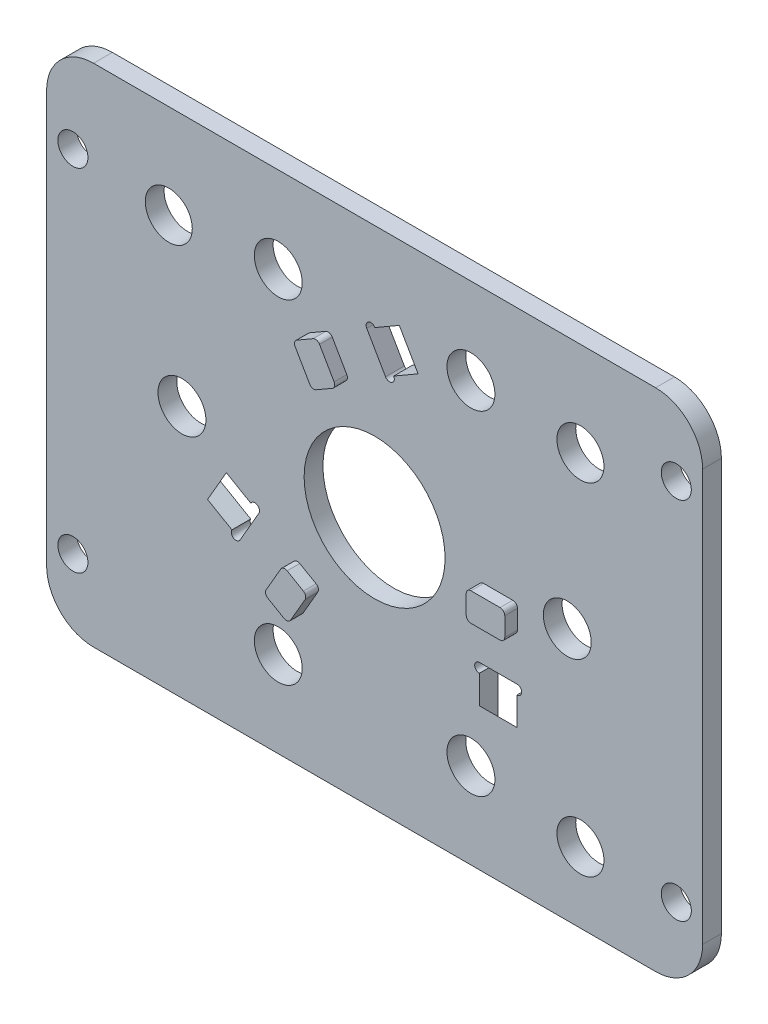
ISO-10303-21;
HEADER;
FILE_DESCRIPTION(('STEP AP214'),'2;1');
FILE_NAME('part.step','',(''),(''),'','','');
FILE_SCHEMA(('AUTOMOTIVE_DESIGN { 1 0 10303 214 1 1 1 1 }'));
ENDSEC;
DATA;
#1=APPLICATION_CONTEXT('core data for automotive mechanical design processes');
#2=APPLICATION_PROTOCOL_DEFINITION('international standard','automotive_design',2000,#1);
#3=PRODUCT_CONTEXT('',#1,'mechanical');
#4=PRODUCT('Part','Part','',(#3));
#5=PRODUCT_RELATED_PRODUCT_CATEGORY('part','',(#4));
#6=PRODUCT_DEFINITION_FORMATION('','',#4);
#7=PRODUCT_DEFINITION_CONTEXT('part definition',#1,'design');
#8=PRODUCT_DEFINITION('design','',#6,#7);
#9=PRODUCT_DEFINITION_SHAPE('','',#8);
#10=(LENGTH_UNIT() NAMED_UNIT(*) SI_UNIT(.MILLI.,.METRE.));
#11=(NAMED_UNIT(*) PLANE_ANGLE_UNIT() SI_UNIT($,.RADIAN.));
#12=(NAMED_UNIT(*) SI_UNIT($,.STERADIAN.) SOLID_ANGLE_UNIT());
#13=UNCERTAINTY_MEASURE_WITH_UNIT(LENGTH_MEASURE(1.E-05),#10,'distance_accuracy_value','');
#14=(GEOMETRIC_REPRESENTATION_CONTEXT(3) GLOBAL_UNCERTAINTY_ASSIGNED_CONTEXT((#13)) GLOBAL_UNIT_ASSIGNED_CONTEXT((#10,
#11,#12)) REPRESENTATION_CONTEXT('',''));
#15=CARTESIAN_POINT('',(0.,0.,0.));
#16=DIRECTION('',(0.,0.,1.));
#17=DIRECTION('',(1.,0.,0.));
#18=AXIS2_PLACEMENT_3D('',#15,#16,#17);
#19=CARTESIAN_POINT('',(0.,0.,2.));
#20=DIRECTION('',(0.,0.,1.));
#21=DIRECTION('',(1.,0.,0.));
#22=AXIS2_PLACEMENT_3D('',#19,#20,#21);
#23=PLANE('',#22);
#24=DIRECTION('',(-0.866025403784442,-0.499999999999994,0.));
#25=VECTOR('',#24,1.);
#26=CARTESIAN_POINT('',(2.6272017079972,19.0105287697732,2.));
#27=LINE('',#26,#25);
#28=CARTESIAN_POINT('',(2.6272017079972,19.0105287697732,2.));
#29=VERTEX_POINT('',#28);
#30=CARTESIAN_POINT('',(0.0291254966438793,17.5105287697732,2.));
#31=VERTEX_POINT('',#30);
#32=EDGE_CURVE('E489',#29,#31,#27,.T.);
#33=ORIENTED_EDGE('',*,*,#32,.F.);
#34=DIRECTION('',(0.499999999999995,-0.866025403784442,0.));
#35=VECTOR('',#34,1.);
#36=CARTESIAN_POINT('',(2.6272017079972,19.0105287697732,2.));
#37=LINE('',#36,#35);
#38=CARTESIAN_POINT('',(4.62720170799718,15.5464271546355,2.));
#39=VERTEX_POINT('',#38);
#40=EDGE_CURVE('E499',#29,#39,#37,.T.);
#41=ORIENTED_EDGE('',*,*,#40,.T.);
#42=DIRECTION('',(-0.866025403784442,-0.499999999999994,0.));
#43=VECTOR('',#42,1.);
#44=CARTESIAN_POINT('',(4.62720170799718,15.5464271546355,2.));
#45=LINE('',#44,#43);
#46=CARTESIAN_POINT('',(2.02912549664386,14.0464271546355,2.));
#47=VERTEX_POINT('',#46);
#48=EDGE_CURVE('E486',#39,#47,#45,.T.);
#49=ORIENTED_EDGE('',*,*,#48,.T.);
#50=CARTESIAN_POINT('',(1.59611279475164,13.7964271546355,2.));
#51=DIRECTION('',(0.,0.,1.));
#52=DIRECTION('',(1.,0.,0.));
#53=AXIS2_PLACEMENT_3D('',#50,#51,#52);
#54=CIRCLE('',#53,0.5);
#55=CARTESIAN_POINT('',(1.16310009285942,13.5464271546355,2.));
#56=VERTEX_POINT('',#55);
#57=EDGE_CURVE('E393',#56,#47,#54,.T.);
#58=ORIENTED_EDGE('',*,*,#57,.F.);
#59=DIRECTION('',(0.499999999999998,-0.86602540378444,0.));
#60=VECTOR('',#59,1.);
#61=CARTESIAN_POINT('',(6.73810009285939,3.89024390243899,2.));
#62=LINE('',#61,#60);
#63=CARTESIAN_POINT('',(-0.83689990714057,17.0105287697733,2.));
#64=VERTEX_POINT('',#63);
#65=EDGE_CURVE('E396',#64,#56,#62,.T.);
#66=ORIENTED_EDGE('',*,*,#65,.F.);
#67=CARTESIAN_POINT('',(-0.403887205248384,17.2605287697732,2.));
#68=DIRECTION('',(0.,0.,1.));
#69=DIRECTION('',(1.,0.,0.));
#70=AXIS2_PLACEMENT_3D('',#67,#68,#69);
#71=CIRCLE('',#70,0.500000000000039);
#72=EDGE_CURVE('E399',#31,#64,#71,.T.);
#73=ORIENTED_EDGE('',*,*,#72,.F.);
#74=EDGE_LOOP('',(#33,#41,#49,#58,#66,#73));
#75=FACE_BOUND('',#74,.T.);
#76=CARTESIAN_POINT('',(21.9,-19.4,2.));
#77=DIRECTION('',(0.,0.,1.));
#78=DIRECTION('',(1.,0.,0.));
#79=AXIS2_PLACEMENT_3D('',#76,#77,#78);
#80=CIRCLE('',#79,2.5);
#81=CARTESIAN_POINT('',(24.4,-19.4,2.));
#82=VERTEX_POINT('',#81);
#83=EDGE_CURVE('E539',#82,#82,#80,.T.);
#84=ORIENTED_EDGE('',*,*,#83,.F.);
#85=EDGE_LOOP('',(#84));
#86=FACE_BOUND('',#85,.T.);
#87=CARTESIAN_POINT('',(-21.9,16.9043170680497,2.));
#88=DIRECTION('',(0.,0.,1.));
#89=DIRECTION('',(1.,0.,0.));
#90=AXIS2_PLACEMENT_3D('',#87,#88,#89);
#91=CIRCLE('',#90,2.5);
#92=CARTESIAN_POINT('',(-19.4,16.9043170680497,2.));
#93=VERTEX_POINT('',#92);
#94=EDGE_CURVE('E536',#93,#93,#91,.T.);
#95=ORIENTED_EDGE('',*,*,#94,.F.);
#96=EDGE_LOOP('',(#95));
#97=FACE_BOUND('',#96,.T.);
#98=CARTESIAN_POINT('',(21.9,16.9043170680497,2.));
#99=DIRECTION('',(0.,0.,1.));
#100=DIRECTION('',(1.,0.,0.));
#101=AXIS2_PLACEMENT_3D('',#98,#99,#100);
#102=CIRCLE('',#101,2.5);
#103=CARTESIAN_POINT('',(24.4,16.9043170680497,2.));
#104=VERTEX_POINT('',#103);
#105=EDGE_CURVE('E533',#104,#104,#102,.T.);
#106=ORIENTED_EDGE('',*,*,#105,.F.);
#107=EDGE_LOOP('',(#106));
#108=FACE_BOUND('',#107,.T.);
#109=CARTESIAN_POINT('',(-32.1024000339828,17.9043170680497,2.));
#110=DIRECTION('',(0.,0.,1.));
#111=DIRECTION('',(1.,0.,0.));
#112=AXIS2_PLACEMENT_3D('',#109,#110,#111);
#113=CIRCLE('',#112,1.6);
#114=CARTESIAN_POINT('',(-30.5024000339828,17.9043170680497,2.));
#115=VERTEX_POINT('',#114);
#116=EDGE_CURVE('E563',#115,#115,#113,.T.);
#117=ORIENTED_EDGE('',*,*,#116,.F.);
#118=EDGE_LOOP('',(#117));
#119=FACE_BOUND('',#118,.T.);
#120=CARTESIAN_POINT('',(-32.1024000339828,-19.4003462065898,2.));
#121=DIRECTION('',(0.,0.,1.));
#122=DIRECTION('',(1.,0.,0.));
#123=AXIS2_PLACEMENT_3D('',#120,#121,#122);
#124=CIRCLE('',#123,1.6);
#125=CARTESIAN_POINT('',(-30.5024000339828,-19.4003462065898,2.));
#126=VERTEX_POINT('',#125);
#127=EDGE_CURVE('E560',#126,#126,#124,.T.);
#128=ORIENTED_EDGE('',*,*,#127,.F.);
#129=EDGE_LOOP('',(#128));
#130=FACE_BOUND('',#129,.T.);
#131=CARTESIAN_POINT('',(32.1024000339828,-19.4003462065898,2.));
#132=DIRECTION('',(0.,0.,1.));
#133=DIRECTION('',(1.,0.,0.));
#134=AXIS2_PLACEMENT_3D('',#131,#132,#133);
#135=CIRCLE('',#134,1.6);
#136=CARTESIAN_POINT('',(33.7024000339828,-19.4003462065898,2.));
#137=VERTEX_POINT('',#136);
#138=EDGE_CURVE('E557',#137,#137,#135,.T.);
#139=ORIENTED_EDGE('',*,*,#138,.F.);
#140=EDGE_LOOP('',(#139));
#141=FACE_BOUND('',#140,.T.);
#142=CARTESIAN_POINT('',(32.1,19.4043170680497,2.));
#143=DIRECTION('',(0.,0.,1.));
#144=DIRECTION('',(1.,0.,0.));
#145=AXIS2_PLACEMENT_3D('',#142,#143,#144);
#146=CIRCLE('',#145,1.6);
#147=CARTESIAN_POINT('',(33.7,19.4043170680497,2.));
#148=VERTEX_POINT('',#147);
#149=EDGE_CURVE('E554',#148,#148,#146,.T.);
#150=ORIENTED_EDGE('',*,*,#149,.F.);
#151=EDGE_LOOP('',(#150));
#152=FACE_BOUND('',#151,.T.);
#153=CARTESIAN_POINT('',(0.,0.,2.));
#154=DIRECTION('',(0.,0.,1.));
#155=DIRECTION('',(1.,0.,0.));
#156=AXIS2_PLACEMENT_3D('',#153,#154,#155);
#157=CIRCLE('',#156,7.5);
#158=CARTESIAN_POINT('',(7.5,0.,2.));
#159=VERTEX_POINT('',#158);
#160=EDGE_CURVE('E569',#159,#159,#157,.T.);
#161=ORIENTED_EDGE('',*,*,#160,.F.);
#162=EDGE_LOOP('',(#161));
#163=FACE_BOUND('',#162,.T.);
#164=CARTESIAN_POINT('',(-20.5,0.,2.));
#165=DIRECTION('',(0.,0.,1.));
#166=DIRECTION('',(1.,0.,0.));
#167=AXIS2_PLACEMENT_3D('',#164,#165,#166);
#168=CIRCLE('',#167,2.55);
#169=CARTESIAN_POINT('',(-17.95,0.,2.));
#170=VERTEX_POINT('',#169);
#171=EDGE_CURVE('E605',#170,#170,#168,.T.);
#172=ORIENTED_EDGE('',*,*,#171,.F.);
#173=EDGE_LOOP('',(#172));
#174=FACE_BOUND('',#173,.T.);
#175=CARTESIAN_POINT('',(-10.2499999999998,-17.7535207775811,2.));
#176=DIRECTION('',(0.,0.,1.));
#177=DIRECTION('',(1.,0.,0.));
#178=AXIS2_PLACEMENT_3D('',#175,#176,#177);
#179=CIRCLE('',#178,2.55);
#180=CARTESIAN_POINT('',(-7.69999999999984,-17.7535207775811,2.));
#181=VERTEX_POINT('',#180);
#182=EDGE_CURVE('E602',#181,#181,#179,.T.);
#183=ORIENTED_EDGE('',*,*,#182,.F.);
#184=EDGE_LOOP('',(#183));
#185=FACE_BOUND('',#184,.T.);
#186=CARTESIAN_POINT('',(-10.2500000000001,17.753520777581,2.));
#187=DIRECTION('',(0.,0.,1.));
#188=DIRECTION('',(1.,0.,0.));
#189=AXIS2_PLACEMENT_3D('',#186,#187,#188);
#190=CIRCLE('',#189,2.55);
#191=CARTESIAN_POINT('',(-7.70000000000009,17.753520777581,2.));
#192=VERTEX_POINT('',#191);
#193=EDGE_CURVE('E599',#192,#192,#190,.T.);
#194=ORIENTED_EDGE('',*,*,#193,.F.);
#195=EDGE_LOOP('',(#194));
#196=FACE_BOUND('',#195,.T.);
#197=CARTESIAN_POINT('',(10.2499999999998,17.7535207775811,2.));
#198=DIRECTION('',(0.,0.,1.));
#199=DIRECTION('',(1.,0.,0.));
#200=AXIS2_PLACEMENT_3D('',#197,#198,#199);
#201=CIRCLE('',#200,2.55);
#202=CARTESIAN_POINT('',(12.7999999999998,17.7535207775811,2.));
#203=VERTEX_POINT('',#202);
#204=EDGE_CURVE('E596',#203,#203,#201,.T.);
#205=ORIENTED_EDGE('',*,*,#204,.F.);
#206=EDGE_LOOP('',(#205));
#207=FACE_BOUND('',#206,.T.);
#208=CARTESIAN_POINT('',(20.5,0.,2.));
#209=DIRECTION('',(0.,0.,1.));
#210=DIRECTION('',(1.,0.,0.));
#211=AXIS2_PLACEMENT_3D('',#208,#209,#210);
#212=CIRCLE('',#211,2.55);
#213=CARTESIAN_POINT('',(23.05,0.,2.));
#214=VERTEX_POINT('',#213);
#215=EDGE_CURVE('E593',#214,#214,#212,.T.);
#216=ORIENTED_EDGE('',*,*,#215,.F.);
#217=EDGE_LOOP('',(#216));
#218=FACE_BOUND('',#217,.T.);
#219=CARTESIAN_POINT('',(10.2500000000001,-17.7535207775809,2.));
#220=DIRECTION('',(0.,0.,1.));
#221=DIRECTION('',(1.,0.,0.));
#222=AXIS2_PLACEMENT_3D('',#219,#220,#221);
#223=CIRCLE('',#222,2.54999999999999);
#224=CARTESIAN_POINT('',(12.8000000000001,-17.7535207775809,2.));
#225=VERTEX_POINT('',#224);
#226=EDGE_CURVE('E576',#225,#225,#223,.T.);
#227=ORIENTED_EDGE('',*,*,#226,.F.);
#228=EDGE_LOOP('',(#227));
#229=FACE_BOUND('',#228,.T.);
#230=CARTESIAN_POINT('',(11.6,-0.780487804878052,2.));
#231=DIRECTION('',(0.,0.,1.));
#232=DIRECTION('',(1.,0.,0.));
#233=AXIS2_PLACEMENT_3D('',#230,#231,#232);
#234=CIRCLE('',#233,0.5);
#235=CARTESIAN_POINT('',(11.1,-0.780487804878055,2.));
#236=VERTEX_POINT('',#235);
#237=CARTESIAN_POINT('',(11.6,-0.280487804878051,2.));
#238=VERTEX_POINT('',#237);
#239=EDGE_CURVE('E762',#236,#238,#234,.F.);
#240=ORIENTED_EDGE('',*,*,#239,.T.);
#241=DIRECTION('',(1.,0.,0.));
#242=VECTOR('',#241,1.);
#243=CARTESIAN_POINT('',(0.,-0.28048780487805,2.));
#244=LINE('',#243,#242);
#245=CARTESIAN_POINT('',(14.7,-0.280487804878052,2.));
#246=VERTEX_POINT('',#245);
#247=EDGE_CURVE('E764',#238,#246,#244,.T.);
#248=ORIENTED_EDGE('',*,*,#247,.T.);
#249=CARTESIAN_POINT('',(14.7,-0.780487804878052,2.));
#250=DIRECTION('',(0.,0.,1.));
#251=DIRECTION('',(1.,0.,0.));
#252=AXIS2_PLACEMENT_3D('',#249,#250,#251);
#253=CIRCLE('',#252,0.5);
#254=CARTESIAN_POINT('',(15.2,-0.780487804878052,2.));
#255=VERTEX_POINT('',#254);
#256=EDGE_CURVE('E749',#255,#246,#253,.T.);
#257=ORIENTED_EDGE('',*,*,#256,.F.);
#258=DIRECTION('',(0.,-1.,0.));
#259=VECTOR('',#258,1.);
#260=CARTESIAN_POINT('',(15.2,0.,2.));
#261=LINE('',#260,#259);
#262=CARTESIAN_POINT('',(15.2,-2.78048780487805,2.));
#263=VERTEX_POINT('',#262);
#264=EDGE_CURVE('E752',#255,#263,#261,.T.);
#265=ORIENTED_EDGE('',*,*,#264,.T.);
#266=CARTESIAN_POINT('',(14.7,-2.78048780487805,2.));
#267=DIRECTION('',(0.,0.,1.));
#268=DIRECTION('',(1.,0.,0.));
#269=AXIS2_PLACEMENT_3D('',#266,#267,#268);
#270=CIRCLE('',#269,0.5);
#271=CARTESIAN_POINT('',(14.7,-3.28048780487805,2.));
#272=VERTEX_POINT('',#271);
#273=EDGE_CURVE('E754',#263,#272,#270,.F.);
#274=ORIENTED_EDGE('',*,*,#273,.T.);
#275=DIRECTION('',(-1.,0.,0.));
#276=VECTOR('',#275,1.);
#277=CARTESIAN_POINT('',(0.,-3.28048780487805,2.));
#278=LINE('',#277,#276);
#279=CARTESIAN_POINT('',(11.6,-3.28048780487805,2.));
#280=VERTEX_POINT('',#279);
#281=EDGE_CURVE('E756',#272,#280,#278,.T.);
#282=ORIENTED_EDGE('',*,*,#281,.T.);
#283=CARTESIAN_POINT('',(11.6,-2.78048780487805,2.));
#284=DIRECTION('',(0.,0.,1.));
#285=DIRECTION('',(1.,0.,0.));
#286=AXIS2_PLACEMENT_3D('',#283,#284,#285);
#287=CIRCLE('',#286,0.5);
#288=CARTESIAN_POINT('',(11.1,-2.78048780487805,2.));
#289=VERTEX_POINT('',#288);
#290=EDGE_CURVE('E758',#280,#289,#287,.F.);
#291=ORIENTED_EDGE('',*,*,#290,.T.);
#292=DIRECTION('',(0.,1.,0.));
#293=VECTOR('',#292,1.);
#294=CARTESIAN_POINT('',(11.1,0.,2.));
#295=LINE('',#294,#293);
#296=EDGE_CURVE('E760',#289,#236,#295,.T.);
#297=ORIENTED_EDGE('',*,*,#296,.T.);
#298=EDGE_LOOP('',(#240,#248,#257,#265,#274,#282,#291,#297));
#299=FACE_BOUND('',#298,.T.);
#300=CARTESIAN_POINT('',(-8.20797307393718,-8.65565078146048,2.));
#301=DIRECTION('',(0.,0.,1.));
#302=DIRECTION('',(1.,0.,0.));
#303=AXIS2_PLACEMENT_3D('',#300,#301,#302);
#304=CIRCLE('',#303,0.5);
#305=CARTESIAN_POINT('',(-7.95797307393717,-8.22263807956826,2.));
#306=VERTEX_POINT('',#305);
#307=CARTESIAN_POINT('',(-8.6409857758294,-8.40565078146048,2.));
#308=VERTEX_POINT('',#307);
#309=EDGE_CURVE('E829',#306,#308,#304,.T.);
#310=ORIENTED_EDGE('',*,*,#309,.F.);
#311=DIRECTION('',(-0.866025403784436,0.500000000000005,0.));
#312=VECTOR('',#311,1.);
#313=CARTESIAN_POINT('',(-5.55000000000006,-9.61288198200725,2.));
#314=LINE('',#313,#312);
#315=CARTESIAN_POINT('',(-6.22592226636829,-9.22263807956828,2.));
#316=VERTEX_POINT('',#315);
#317=EDGE_CURVE('E832',#316,#306,#314,.T.);
#318=ORIENTED_EDGE('',*,*,#317,.F.);
#319=CARTESIAN_POINT('',(-6.47592226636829,-9.6556507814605,2.));
#320=DIRECTION('',(0.,0.,1.));
#321=DIRECTION('',(1.,0.,0.));
#322=AXIS2_PLACEMENT_3D('',#319,#320,#321);
#323=CIRCLE('',#322,0.5);
#324=CARTESIAN_POINT('',(-6.04290956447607,-9.9056507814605,2.));
#325=VERTEX_POINT('',#324);
#326=EDGE_CURVE('E835',#325,#316,#323,.T.);
#327=ORIENTED_EDGE('',*,*,#326,.F.);
#328=DIRECTION('',(-0.5,-0.866025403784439,0.));
#329=VECTOR('',#328,1.);
#330=CARTESIAN_POINT('',(-0.242909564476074,0.140243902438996,2.));
#331=LINE('',#330,#329);
#332=CARTESIAN_POINT('',(-7.59290956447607,-12.5903295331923,2.));
#333=VERTEX_POINT('',#332);
#334=EDGE_CURVE('E838',#325,#333,#331,.T.);
#335=ORIENTED_EDGE('',*,*,#334,.T.);
#336=CARTESIAN_POINT('',(-8.02592226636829,-12.3403295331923,2.));
#337=DIRECTION('',(0.,0.,1.));
#338=DIRECTION('',(1.,0.,0.));
#339=AXIS2_PLACEMENT_3D('',#336,#337,#338);
#340=CIRCLE('',#339,0.5);
#341=CARTESIAN_POINT('',(-8.2759222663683,-12.7733422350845,2.));
#342=VERTEX_POINT('',#341);
#343=EDGE_CURVE('E840',#333,#342,#340,.F.);
#344=ORIENTED_EDGE('',*,*,#343,.T.);
#345=DIRECTION('',(0.866025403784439,-0.5,0.));
#346=VECTOR('',#345,1.);
#347=CARTESIAN_POINT('',(-7.6,-13.1635861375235,2.));
#348=LINE('',#347,#346);
#349=CARTESIAN_POINT('',(-10.0079730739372,-11.7733422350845,2.));
#350=VERTEX_POINT('',#349);
#351=EDGE_CURVE('E842',#350,#342,#348,.T.);
#352=ORIENTED_EDGE('',*,*,#351,.F.);
#353=CARTESIAN_POINT('',(-9.75797307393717,-11.3403295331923,2.));
#354=DIRECTION('',(0.,0.,1.));
#355=DIRECTION('',(1.,0.,0.));
#356=AXIS2_PLACEMENT_3D('',#353,#354,#355);
#357=CIRCLE('',#356,0.5);
#358=CARTESIAN_POINT('',(-10.1909857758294,-11.0903295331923,2.));
#359=VERTEX_POINT('',#358);
#360=EDGE_CURVE('E388',#359,#350,#357,.T.);
#361=ORIENTED_EDGE('',*,*,#360,.F.);
#362=DIRECTION('',(-0.499999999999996,-0.866025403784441,0.));
#363=VECTOR('',#362,1.);
#364=CARTESIAN_POINT('',(-2.84098577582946,1.64024390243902,2.));
#365=LINE('',#364,#363);
#366=EDGE_CURVE('E383',#308,#359,#365,.T.);
#367=ORIENTED_EDGE('',*,*,#366,.F.);
#368=EDGE_LOOP('',(#310,#318,#327,#335,#344,#352,#361,#367));
#369=FACE_BOUND('',#368,.T.);
#370=CARTESIAN_POINT('',(-5.1240777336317,10.4361385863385,2.));
#371=DIRECTION('',(0.,0.,1.));
#372=DIRECTION('',(1.,0.,0.));
#373=AXIS2_PLACEMENT_3D('',#370,#371,#372);
#374=CIRCLE('',#373,0.500000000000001);
#375=CARTESIAN_POINT('',(-5.55709043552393,10.1861385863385,2.));
#376=VERTEX_POINT('',#375);
#377=CARTESIAN_POINT('',(-4.8740777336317,10.0031258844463,2.));
#378=VERTEX_POINT('',#377);
#379=EDGE_CURVE('E437',#376,#378,#374,.T.);
#380=ORIENTED_EDGE('',*,*,#379,.F.);
#381=DIRECTION('',(0.499999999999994,-0.866025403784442,0.));
#382=VECTOR('',#381,1.);
#383=CARTESIAN_POINT('',(0.242909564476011,0.140243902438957,2.));
#384=LINE('',#383,#382);
#385=CARTESIAN_POINT('',(-7.10709043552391,12.8708173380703,2.));
#386=VERTEX_POINT('',#385);
#387=EDGE_CURVE('E809',#386,#376,#384,.T.);
#388=ORIENTED_EDGE('',*,*,#387,.F.);
#389=CARTESIAN_POINT('',(-6.67407773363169,13.1208173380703,2.));
#390=DIRECTION('',(0.,0.,1.));
#391=DIRECTION('',(1.,0.,0.));
#392=AXIS2_PLACEMENT_3D('',#389,#390,#391);
#393=CIRCLE('',#392,0.499999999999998);
#394=CARTESIAN_POINT('',(-6.92407773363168,13.5538300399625,2.));
#395=VERTEX_POINT('',#394);
#396=EDGE_CURVE('E811',#386,#395,#393,.F.);
#397=ORIENTED_EDGE('',*,*,#396,.T.);
#398=DIRECTION('',(0.866025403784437,0.500000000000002,0.));
#399=VECTOR('',#398,1.);
#400=CARTESIAN_POINT('',(-7.60000000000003,13.1635861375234,2.));
#401=LINE('',#400,#399);
#402=CARTESIAN_POINT('',(-5.19202692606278,14.5538300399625,2.));
#403=VERTEX_POINT('',#402);
#404=EDGE_CURVE('E814',#395,#403,#401,.T.);
#405=ORIENTED_EDGE('',*,*,#404,.T.);
#406=CARTESIAN_POINT('',(-4.94202692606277,14.1208173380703,2.));
#407=DIRECTION('',(0.,0.,1.));
#408=DIRECTION('',(1.,0.,0.));
#409=AXIS2_PLACEMENT_3D('',#406,#407,#408);
#410=CIRCLE('',#409,0.500000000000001);
#411=CARTESIAN_POINT('',(-4.50901422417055,14.3708173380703,2.));
#412=VERTEX_POINT('',#411);
#413=EDGE_CURVE('E817',#403,#412,#410,.F.);
#414=ORIENTED_EDGE('',*,*,#413,.T.);
#415=DIRECTION('',(0.499999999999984,-0.866025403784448,0.));
#416=VECTOR('',#415,1.);
#417=CARTESIAN_POINT('',(2.84098577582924,1.64024390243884,2.));
#418=LINE('',#417,#416);
#419=CARTESIAN_POINT('',(-2.95901422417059,11.6861385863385,2.));
#420=VERTEX_POINT('',#419);
#421=EDGE_CURVE('E820',#412,#420,#418,.T.);
#422=ORIENTED_EDGE('',*,*,#421,.T.);
#423=CARTESIAN_POINT('',(-3.39202692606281,11.4361385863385,2.));
#424=DIRECTION('',(0.,0.,1.));
#425=DIRECTION('',(1.,0.,0.));
#426=AXIS2_PLACEMENT_3D('',#423,#424,#425);
#427=CIRCLE('',#426,0.5);
#428=CARTESIAN_POINT('',(-3.14202692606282,11.0031258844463,2.));
#429=VERTEX_POINT('',#428);
#430=EDGE_CURVE('E823',#420,#429,#427,.F.);
#431=ORIENTED_EDGE('',*,*,#430,.T.);
#432=DIRECTION('',(-0.866025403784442,-0.499999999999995,0.));
#433=VECTOR('',#432,1.);
#434=CARTESIAN_POINT('',(-5.54999999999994,9.6128819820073,2.));
#435=LINE('',#434,#433);
#436=EDGE_CURVE('E826',#429,#378,#435,.T.);
#437=ORIENTED_EDGE('',*,*,#436,.T.);
#438=EDGE_LOOP('',(#380,#388,#397,#405,#414,#422,#431,#437));
#439=FACE_BOUND('',#438,.T.);
#440=DIRECTION('',(0.,-1.,0.));
#441=VECTOR('',#440,1.);
#442=CARTESIAN_POINT('',(34.9,0.,2.));
#443=LINE('',#442,#441);
#444=CARTESIAN_POINT('',(34.9,21.9043170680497,2.));
#445=VERTEX_POINT('',#444);
#446=CARTESIAN_POINT('',(34.9,-21.9,2.));
#447=VERTEX_POINT('',#446);
#448=EDGE_CURVE('E656',#445,#447,#443,.T.);
#449=ORIENTED_EDGE('',*,*,#448,.F.);
#450=CARTESIAN_POINT('',(29.9,21.9043170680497,2.));
#451=DIRECTION('',(0.,0.,1.));
#452=DIRECTION('',(1.,0.,0.));
#453=AXIS2_PLACEMENT_3D('',#450,#451,#452);
#454=CIRCLE('',#453,5.);
#455=CARTESIAN_POINT('',(29.9,26.9043170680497,2.));
#456=VERTEX_POINT('',#455);
#457=EDGE_CURVE('E658',#445,#456,#454,.T.);
#458=ORIENTED_EDGE('',*,*,#457,.T.);
#459=DIRECTION('',(1.,0.,0.));
#460=VECTOR('',#459,1.);
#461=CARTESIAN_POINT('',(0.,26.9043170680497,2.));
#462=LINE('',#461,#460);
#463=CARTESIAN_POINT('',(-29.9,26.9043170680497,2.));
#464=VERTEX_POINT('',#463);
#465=EDGE_CURVE('E632',#464,#456,#462,.T.);
#466=ORIENTED_EDGE('',*,*,#465,.F.);
#467=CARTESIAN_POINT('',(-29.9,21.9043170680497,2.));
#468=DIRECTION('',(0.,0.,1.));
#469=DIRECTION('',(1.,0.,0.));
#470=AXIS2_PLACEMENT_3D('',#467,#468,#469);
#471=CIRCLE('',#470,5.);
#472=CARTESIAN_POINT('',(-34.9,21.9043170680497,2.));
#473=VERTEX_POINT('',#472);
#474=EDGE_CURVE('E646',#473,#464,#471,.F.);
#475=ORIENTED_EDGE('',*,*,#474,.F.);
#476=DIRECTION('',(0.,1.,0.));
#477=VECTOR('',#476,1.);
#478=CARTESIAN_POINT('',(-34.9,0.,2.));
#479=LINE('',#478,#477);
#480=CARTESIAN_POINT('',(-34.9,-21.9,2.));
#481=VERTEX_POINT('',#480);
#482=EDGE_CURVE('E648',#481,#473,#479,.T.);
#483=ORIENTED_EDGE('',*,*,#482,.F.);
#484=CARTESIAN_POINT('',(-29.9,-21.9,2.));
#485=DIRECTION('',(0.,0.,1.));
#486=DIRECTION('',(1.,0.,0.));
#487=AXIS2_PLACEMENT_3D('',#484,#485,#486);
#488=CIRCLE('',#487,5.);
#489=CARTESIAN_POINT('',(-29.9,-26.9,2.));
#490=VERTEX_POINT('',#489);
#491=EDGE_CURVE('E650',#490,#481,#488,.F.);
#492=ORIENTED_EDGE('',*,*,#491,.F.);
#493=DIRECTION('',(-1.,0.,0.));
#494=VECTOR('',#493,1.);
#495=CARTESIAN_POINT('',(0.,-26.9,2.));
#496=LINE('',#495,#494);
#497=CARTESIAN_POINT('',(29.9,-26.9,2.));
#498=VERTEX_POINT('',#497);
#499=EDGE_CURVE('E652',#498,#490,#496,.T.);
#500=ORIENTED_EDGE('',*,*,#499,.F.);
#501=CARTESIAN_POINT('',(29.9,-21.9,2.));
#502=DIRECTION('',(0.,0.,1.));
#503=DIRECTION('',(1.,0.,0.));
#504=AXIS2_PLACEMENT_3D('',#501,#502,#503);
#505=CIRCLE('',#504,5.);
#506=EDGE_CURVE('E654',#447,#498,#505,.F.);
#507=ORIENTED_EDGE('',*,*,#506,.F.);
#508=EDGE_LOOP('',(#449,#458,#466,#475,#483,#492,#500,#507));
#509=FACE_BOUND('',#508,.T.);
#510=CARTESIAN_POINT('',(15.15,-8.28048780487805,2.));
#511=DIRECTION('',(0.,0.,1.));
#512=DIRECTION('',(1.,0.,0.));
#513=AXIS2_PLACEMENT_3D('',#510,#511,#512);
#514=CIRCLE('',#513,0.499999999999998);
#515=CARTESIAN_POINT('',(15.15,-8.78048780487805,2.));
#516=VERTEX_POINT('',#515);
#517=CARTESIAN_POINT('',(15.15,-7.78048780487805,2.));
#518=VERTEX_POINT('',#517);
#519=EDGE_CURVE('E402',#516,#518,#514,.T.);
#520=ORIENTED_EDGE('',*,*,#519,.F.);
#521=DIRECTION('',(0.,1.,0.));
#522=VECTOR('',#521,1.);
#523=CARTESIAN_POINT('',(15.15,-11.780487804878,2.));
#524=LINE('',#523,#522);
#525=CARTESIAN_POINT('',(15.15,-11.780487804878,2.));
#526=VERTEX_POINT('',#525);
#527=EDGE_CURVE('E504',#526,#516,#524,.T.);
#528=ORIENTED_EDGE('',*,*,#527,.F.);
#529=DIRECTION('',(-1.,0.,0.));
#530=VECTOR('',#529,1.);
#531=CARTESIAN_POINT('',(15.15,-11.780487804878,2.));
#532=LINE('',#531,#530);
#533=CARTESIAN_POINT('',(11.15,-11.780487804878,2.));
#534=VERTEX_POINT('',#533);
#535=EDGE_CURVE('E520',#526,#534,#532,.T.);
#536=ORIENTED_EDGE('',*,*,#535,.T.);
#537=DIRECTION('',(0.,1.,0.));
#538=VECTOR('',#537,1.);
#539=CARTESIAN_POINT('',(11.15,-11.780487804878,2.));
#540=LINE('',#539,#538);
#541=CARTESIAN_POINT('',(11.15,-8.78048780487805,2.));
#542=VERTEX_POINT('',#541);
#543=EDGE_CURVE('E502',#534,#542,#540,.T.);
#544=ORIENTED_EDGE('',*,*,#543,.T.);
#545=CARTESIAN_POINT('',(11.15,-8.28048780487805,2.));
#546=DIRECTION('',(0.,0.,1.));
#547=DIRECTION('',(1.,0.,0.));
#548=AXIS2_PLACEMENT_3D('',#545,#546,#547);
#549=CIRCLE('',#548,0.499999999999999);
#550=CARTESIAN_POINT('',(11.15,-7.78048780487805,2.));
#551=VERTEX_POINT('',#550);
#552=EDGE_CURVE('E405',#551,#542,#549,.T.);
#553=ORIENTED_EDGE('',*,*,#552,.F.);
#554=DIRECTION('',(1.,0.,0.));
#555=VECTOR('',#554,1.);
#556=CARTESIAN_POINT('',(0.,-7.78048780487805,2.));
#557=LINE('',#556,#555);
#558=EDGE_CURVE('E408',#551,#518,#557,.T.);
#559=ORIENTED_EDGE('',*,*,#558,.T.);
#560=EDGE_LOOP('',(#520,#528,#536,#544,#553,#559));
#561=FACE_BOUND('',#560,.T.);
#562=CARTESIAN_POINT('',(-14.7461127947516,-8.98004096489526,2.));
#563=DIRECTION('',(0.,0.,1.));
#564=DIRECTION('',(1.,0.,0.));
#565=AXIS2_PLACEMENT_3D('',#562,#563,#564);
#566=CIRCLE('',#565,0.500000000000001);
#567=CARTESIAN_POINT('',(-15.1791254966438,-8.73004096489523,2.));
#568=VERTEX_POINT('',#567);
#569=CARTESIAN_POINT('',(-14.3131000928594,-9.23004096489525,2.));
#570=VERTEX_POINT('',#569);
#571=EDGE_CURVE('E373',#568,#570,#566,.T.);
#572=ORIENTED_EDGE('',*,*,#571,.F.);
#573=DIRECTION('',(0.866025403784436,-0.500000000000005,0.));
#574=VECTOR('',#573,1.);
#575=CARTESIAN_POINT('',(-17.7772017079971,-7.23004096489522,2.));
#576=LINE('',#575,#574);
#577=CARTESIAN_POINT('',(-17.7772017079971,-7.23004096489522,2.));
#578=VERTEX_POINT('',#577);
#579=EDGE_CURVE('E358',#578,#568,#576,.T.);
#580=ORIENTED_EDGE('',*,*,#579,.F.);
#581=DIRECTION('',(0.500000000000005,0.866025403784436,0.));
#582=VECTOR('',#581,1.);
#583=CARTESIAN_POINT('',(-17.7772017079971,-7.23004096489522,2.));
#584=LINE('',#583,#582);
#585=CARTESIAN_POINT('',(-15.7772017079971,-3.76593934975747,2.));
#586=VERTEX_POINT('',#585);
#587=EDGE_CURVE('E469',#578,#586,#584,.T.);
#588=ORIENTED_EDGE('',*,*,#587,.T.);
#589=DIRECTION('',(0.866025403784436,-0.500000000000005,0.));
#590=VECTOR('',#589,1.);
#591=CARTESIAN_POINT('',(-15.7772017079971,-3.76593934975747,2.));
#592=LINE('',#591,#590);
#593=CARTESIAN_POINT('',(-13.1791254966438,-5.26593934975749,2.));
#594=VERTEX_POINT('',#593);
#595=EDGE_CURVE('E468',#586,#594,#592,.T.);
#596=ORIENTED_EDGE('',*,*,#595,.T.);
#597=CARTESIAN_POINT('',(-12.7461127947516,-5.5159393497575,2.));
#598=DIRECTION('',(0.,0.,1.));
#599=DIRECTION('',(1.,0.,0.));
#600=AXIS2_PLACEMENT_3D('',#597,#598,#599);
#601=CIRCLE('',#600,0.500000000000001);
#602=CARTESIAN_POINT('',(-12.3131000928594,-5.7659393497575,2.));
#603=VERTEX_POINT('',#602);
#604=EDGE_CURVE('E382',#603,#594,#601,.T.);
#605=ORIENTED_EDGE('',*,*,#604,.F.);
#606=DIRECTION('',(-0.5,-0.866025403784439,0.));
#607=VECTOR('',#606,1.);
#608=CARTESIAN_POINT('',(-6.73810009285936,3.89024390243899,2.));
#609=LINE('',#608,#607);
#610=EDGE_CURVE('E380',#603,#570,#609,.T.);
#611=ORIENTED_EDGE('',*,*,#610,.T.);
#612=EDGE_LOOP('',(#572,#580,#588,#596,#605,#611));
#613=FACE_BOUND('',#612,.T.);
#614=ADVANCED_FACE('F39',(#75,#86,#97,#108,#119,#130,#141,#152,#163,#174,#185,#196,#207,#218,
#229,#299,#369,#439,#509,#561,#613),#23,.T.);
#615=CARTESIAN_POINT('',(0.,0.,0.));
#616=DIRECTION('',(0.,0.,1.));
#617=DIRECTION('',(1.,0.,0.));
#618=AXIS2_PLACEMENT_3D('',#615,#616,#617);
#619=PLANE('',#618);
#620=DIRECTION('',(0.,-1.,0.));
#621=VECTOR('',#620,1.);
#622=CARTESIAN_POINT('',(15.15,-8.78048780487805,0.));
#623=LINE('',#622,#621);
#624=CARTESIAN_POINT('',(15.15,-8.78048780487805,0.));
#625=VERTEX_POINT('',#624);
#626=CARTESIAN_POINT('',(15.15,-13.7804878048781,0.));
#627=VERTEX_POINT('',#626);
#628=EDGE_CURVE('E506',#625,#627,#623,.T.);
#629=ORIENTED_EDGE('',*,*,#628,.F.);
#630=CARTESIAN_POINT('',(15.15,-8.28048780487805,0.));
#631=DIRECTION('',(0.,0.,1.));
#632=DIRECTION('',(1.,0.,0.));
#633=AXIS2_PLACEMENT_3D('',#630,#631,#632);
#634=CIRCLE('',#633,0.499999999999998);
#635=CARTESIAN_POINT('',(15.15,-7.78048780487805,0.));
#636=VERTEX_POINT('',#635);
#637=EDGE_CURVE('E428',#625,#636,#634,.T.);
#638=ORIENTED_EDGE('',*,*,#637,.T.);
#639=DIRECTION('',(1.,0.,0.));
#640=VECTOR('',#639,1.);
#641=CARTESIAN_POINT('',(0.,-7.78048780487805,0.));
#642=LINE('',#641,#640);
#643=CARTESIAN_POINT('',(11.15,-7.78048780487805,0.));
#644=VERTEX_POINT('',#643);
#645=EDGE_CURVE('E434',#644,#636,#642,.T.);
#646=ORIENTED_EDGE('',*,*,#645,.F.);
#647=CARTESIAN_POINT('',(11.15,-8.28048780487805,0.));
#648=DIRECTION('',(0.,0.,1.));
#649=DIRECTION('',(1.,0.,0.));
#650=AXIS2_PLACEMENT_3D('',#647,#648,#649);
#651=CIRCLE('',#650,0.499999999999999);
#652=CARTESIAN_POINT('',(11.15,-8.78048780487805,0.));
#653=VERTEX_POINT('',#652);
#654=EDGE_CURVE('E431',#644,#653,#651,.T.);
#655=ORIENTED_EDGE('',*,*,#654,.T.);
#656=DIRECTION('',(0.,-1.,0.));
#657=VECTOR('',#656,1.);
#658=CARTESIAN_POINT('',(11.15,-8.78048780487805,0.));
#659=LINE('',#658,#657);
#660=CARTESIAN_POINT('',(11.15,-13.7804878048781,0.));
#661=VERTEX_POINT('',#660);
#662=EDGE_CURVE('E515',#653,#661,#659,.T.);
#663=ORIENTED_EDGE('',*,*,#662,.T.);
#664=DIRECTION('',(-1.,0.,0.));
#665=VECTOR('',#664,1.);
#666=CARTESIAN_POINT('',(15.15,-13.7804878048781,0.));
#667=LINE('',#666,#665);
#668=EDGE_CURVE('E512',#627,#661,#667,.T.);
#669=ORIENTED_EDGE('',*,*,#668,.F.);
#670=EDGE_LOOP('',(#629,#638,#646,#655,#663,#669));
#671=FACE_BOUND('',#670,.T.);
#672=CARTESIAN_POINT('',(21.9,-19.4,0.));
#673=DIRECTION('',(0.,0.,-1.));
#674=DIRECTION('',(-1.,0.,0.));
#675=AXIS2_PLACEMENT_3D('',#672,#673,#674);
#676=CIRCLE('',#675,2.5);
#677=CARTESIAN_POINT('',(19.4,-19.4,0.));
#678=VERTEX_POINT('',#677);
#679=EDGE_CURVE('E523',#678,#678,#676,.T.);
#680=ORIENTED_EDGE('',*,*,#679,.F.);
#681=EDGE_LOOP('',(#680));
#682=FACE_BOUND('',#681,.T.);
#683=CARTESIAN_POINT('',(-21.9,16.9043170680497,0.));
#684=DIRECTION('',(0.,0.,-1.));
#685=DIRECTION('',(1.,0.,0.));
#686=AXIS2_PLACEMENT_3D('',#683,#684,#685);
#687=CIRCLE('',#686,2.5);
#688=CARTESIAN_POINT('',(-19.4,16.9043170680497,0.));
#689=VERTEX_POINT('',#688);
#690=EDGE_CURVE('E525',#689,#689,#687,.T.);
#691=ORIENTED_EDGE('',*,*,#690,.F.);
#692=EDGE_LOOP('',(#691));
#693=FACE_BOUND('',#692,.T.);
#694=CARTESIAN_POINT('',(21.9,16.9043170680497,0.));
#695=DIRECTION('',(0.,0.,-1.));
#696=DIRECTION('',(-1.,0.,0.));
#697=AXIS2_PLACEMENT_3D('',#694,#695,#696);
#698=CIRCLE('',#697,2.5);
#699=CARTESIAN_POINT('',(19.4,16.9043170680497,0.));
#700=VERTEX_POINT('',#699);
#701=EDGE_CURVE('E528',#700,#700,#698,.T.);
#702=ORIENTED_EDGE('',*,*,#701,.F.);
#703=EDGE_LOOP('',(#702));
#704=FACE_BOUND('',#703,.T.);
#705=CARTESIAN_POINT('',(-32.1024000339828,17.9043170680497,0.));
#706=DIRECTION('',(0.,0.,-1.));
#707=DIRECTION('',(-1.,0.,0.));
#708=AXIS2_PLACEMENT_3D('',#705,#706,#707);
#709=CIRCLE('',#708,1.6);
#710=CARTESIAN_POINT('',(-33.7024000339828,17.9043170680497,0.));
#711=VERTEX_POINT('',#710);
#712=EDGE_CURVE('E542',#711,#711,#709,.T.);
#713=ORIENTED_EDGE('',*,*,#712,.F.);
#714=EDGE_LOOP('',(#713));
#715=FACE_BOUND('',#714,.T.);
#716=CARTESIAN_POINT('',(-32.1024000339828,-19.4003462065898,0.));
#717=DIRECTION('',(0.,0.,-1.));
#718=DIRECTION('',(-1.,0.,0.));
#719=AXIS2_PLACEMENT_3D('',#716,#717,#718);
#720=CIRCLE('',#719,1.6);
#721=CARTESIAN_POINT('',(-33.7024000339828,-19.4003462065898,0.));
#722=VERTEX_POINT('',#721);
#723=EDGE_CURVE('E547',#722,#722,#720,.T.);
#724=ORIENTED_EDGE('',*,*,#723,.F.);
#725=EDGE_LOOP('',(#724));
#726=FACE_BOUND('',#725,.T.);
#727=CARTESIAN_POINT('',(32.1024000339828,-19.4003462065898,0.));
#728=DIRECTION('',(0.,0.,-1.));
#729=DIRECTION('',(1.,0.,0.));
#730=AXIS2_PLACEMENT_3D('',#727,#728,#729);
#731=CIRCLE('',#730,1.6);
#732=CARTESIAN_POINT('',(33.7024000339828,-19.4003462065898,0.));
#733=VERTEX_POINT('',#732);
#734=EDGE_CURVE('E543',#733,#733,#731,.T.);
#735=ORIENTED_EDGE('',*,*,#734,.F.);
#736=EDGE_LOOP('',(#735));
#737=FACE_BOUND('',#736,.T.);
#738=CARTESIAN_POINT('',(32.1,19.4043170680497,0.));
#739=DIRECTION('',(0.,0.,-1.));
#740=DIRECTION('',(-1.,0.,0.));
#741=AXIS2_PLACEMENT_3D('',#738,#739,#740);
#742=CIRCLE('',#741,1.6);
#743=CARTESIAN_POINT('',(30.5,19.4043170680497,0.));
#744=VERTEX_POINT('',#743);
#745=EDGE_CURVE('E546',#744,#744,#742,.T.);
#746=ORIENTED_EDGE('',*,*,#745,.F.);
#747=EDGE_LOOP('',(#746));
#748=FACE_BOUND('',#747,.T.);
#749=CARTESIAN_POINT('',(0.,0.,0.));
#750=DIRECTION('',(0.,0.,-1.));
#751=DIRECTION('',(-1.,0.,0.));
#752=AXIS2_PLACEMENT_3D('',#749,#750,#751);
#753=CIRCLE('',#752,7.5);
#754=CARTESIAN_POINT('',(-7.5,0.,0.));
#755=VERTEX_POINT('',#754);
#756=EDGE_CURVE('E566',#755,#755,#753,.T.);
#757=ORIENTED_EDGE('',*,*,#756,.F.);
#758=EDGE_LOOP('',(#757));
#759=FACE_BOUND('',#758,.T.);
#760=CARTESIAN_POINT('',(-20.5,0.,0.));
#761=DIRECTION('',(0.,0.,-1.));
#762=DIRECTION('',(-1.,0.,0.));
#763=AXIS2_PLACEMENT_3D('',#760,#761,#762);
#764=CIRCLE('',#763,2.55);
#765=CARTESIAN_POINT('',(-23.05,0.,0.));
#766=VERTEX_POINT('',#765);
#767=EDGE_CURVE('E573',#766,#766,#764,.T.);
#768=ORIENTED_EDGE('',*,*,#767,.F.);
#769=EDGE_LOOP('',(#768));
#770=FACE_BOUND('',#769,.T.);
#771=CARTESIAN_POINT('',(-10.2499999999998,-17.7535207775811,0.));
#772=DIRECTION('',(0.,0.,-1.));
#773=DIRECTION('',(-1.,0.,0.));
#774=AXIS2_PLACEMENT_3D('',#771,#772,#773);
#775=CIRCLE('',#774,2.55);
#776=CARTESIAN_POINT('',(-12.7999999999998,-17.7535207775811,0.));
#777=VERTEX_POINT('',#776);
#778=EDGE_CURVE('E572',#777,#777,#775,.T.);
#779=ORIENTED_EDGE('',*,*,#778,.F.);
#780=EDGE_LOOP('',(#779));
#781=FACE_BOUND('',#780,.T.);
#782=CARTESIAN_POINT('',(-10.2500000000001,17.753520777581,0.));
#783=DIRECTION('',(0.,0.,-1.));
#784=DIRECTION('',(-1.,0.,0.));
#785=AXIS2_PLACEMENT_3D('',#782,#783,#784);
#786=CIRCLE('',#785,2.55);
#787=CARTESIAN_POINT('',(-12.8000000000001,17.753520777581,0.));
#788=VERTEX_POINT('',#787);
#789=EDGE_CURVE('E580',#788,#788,#786,.T.);
#790=ORIENTED_EDGE('',*,*,#789,.F.);
#791=EDGE_LOOP('',(#790));
#792=FACE_BOUND('',#791,.T.);
#793=CARTESIAN_POINT('',(10.2499999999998,17.7535207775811,0.));
#794=DIRECTION('',(0.,0.,-1.));
#795=DIRECTION('',(-1.,0.,0.));
#796=AXIS2_PLACEMENT_3D('',#793,#794,#795);
#797=CIRCLE('',#796,2.55);
#798=CARTESIAN_POINT('',(7.69999999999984,17.7535207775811,0.));
#799=VERTEX_POINT('',#798);
#800=EDGE_CURVE('E586',#799,#799,#797,.T.);
#801=ORIENTED_EDGE('',*,*,#800,.F.);
#802=EDGE_LOOP('',(#801));
#803=FACE_BOUND('',#802,.T.);
#804=CARTESIAN_POINT('',(20.5,0.,0.));
#805=DIRECTION('',(0.,0.,-1.));
#806=DIRECTION('',(-1.,0.,0.));
#807=AXIS2_PLACEMENT_3D('',#804,#805,#806);
#808=CIRCLE('',#807,2.55);
#809=CARTESIAN_POINT('',(17.95,0.,0.));
#810=VERTEX_POINT('',#809);
#811=EDGE_CURVE('E583',#810,#810,#808,.T.);
#812=ORIENTED_EDGE('',*,*,#811,.F.);
#813=EDGE_LOOP('',(#812));
#814=FACE_BOUND('',#813,.T.);
#815=CARTESIAN_POINT('',(10.2500000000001,-17.7535207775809,0.));
#816=DIRECTION('',(0.,0.,-1.));
#817=DIRECTION('',(-1.,0.,0.));
#818=AXIS2_PLACEMENT_3D('',#815,#816,#817);
#819=CIRCLE('',#818,2.54999999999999);
#820=CARTESIAN_POINT('',(7.70000000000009,-17.7535207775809,0.));
#821=VERTEX_POINT('',#820);
#822=EDGE_CURVE('E577',#821,#821,#819,.T.);
#823=ORIENTED_EDGE('',*,*,#822,.F.);
#824=EDGE_LOOP('',(#823));
#825=FACE_BOUND('',#824,.T.);
#826=DIRECTION('',(0.499999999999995,-0.866025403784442,0.));
#827=VECTOR('',#826,1.);
#828=CARTESIAN_POINT('',(4.35925251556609,20.0105287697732,0.));
#829=LINE('',#828,#827);
#830=CARTESIAN_POINT('',(4.35925251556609,20.0105287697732,0.));
#831=VERTEX_POINT('',#830);
#832=CARTESIAN_POINT('',(6.35925251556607,16.5464271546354,0.));
#833=VERTEX_POINT('',#832);
#834=EDGE_CURVE('E491',#831,#833,#829,.T.);
#835=ORIENTED_EDGE('',*,*,#834,.F.);
#836=DIRECTION('',(0.866025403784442,0.499999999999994,0.));
#837=VECTOR('',#836,1.);
#838=CARTESIAN_POINT('',(0.0291254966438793,17.5105287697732,0.));
#839=LINE('',#838,#837);
#840=CARTESIAN_POINT('',(0.0291254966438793,17.5105287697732,0.));
#841=VERTEX_POINT('',#840);
#842=EDGE_CURVE('E482',#841,#831,#839,.T.);
#843=ORIENTED_EDGE('',*,*,#842,.F.);
#844=CARTESIAN_POINT('',(-0.403887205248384,17.2605287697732,0.));
#845=DIRECTION('',(0.,0.,1.));
#846=DIRECTION('',(1.,0.,0.));
#847=AXIS2_PLACEMENT_3D('',#844,#845,#846);
#848=CIRCLE('',#847,0.500000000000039);
#849=CARTESIAN_POINT('',(-0.83689990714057,17.0105287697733,0.));
#850=VERTEX_POINT('',#849);
#851=EDGE_CURVE('E425',#841,#850,#848,.T.);
#852=ORIENTED_EDGE('',*,*,#851,.T.);
#853=DIRECTION('',(0.499999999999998,-0.86602540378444,0.));
#854=VECTOR('',#853,1.);
#855=CARTESIAN_POINT('',(6.73810009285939,3.89024390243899,0.));
#856=LINE('',#855,#854);
#857=CARTESIAN_POINT('',(1.16310009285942,13.5464271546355,0.));
#858=VERTEX_POINT('',#857);
#859=EDGE_CURVE('E422',#850,#858,#856,.T.);
#860=ORIENTED_EDGE('',*,*,#859,.T.);
#861=CARTESIAN_POINT('',(1.59611279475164,13.7964271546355,0.));
#862=DIRECTION('',(0.,0.,1.));
#863=DIRECTION('',(1.,0.,0.));
#864=AXIS2_PLACEMENT_3D('',#861,#862,#863);
#865=CIRCLE('',#864,0.5);
#866=CARTESIAN_POINT('',(2.02912549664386,14.0464271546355,0.));
#867=VERTEX_POINT('',#866);
#868=EDGE_CURVE('E419',#858,#867,#865,.T.);
#869=ORIENTED_EDGE('',*,*,#868,.T.);
#870=DIRECTION('',(0.866025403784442,0.499999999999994,0.));
#871=VECTOR('',#870,1.);
#872=CARTESIAN_POINT('',(2.02912549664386,14.0464271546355,0.));
#873=LINE('',#872,#871);
#874=EDGE_CURVE('E479',#867,#833,#873,.T.);
#875=ORIENTED_EDGE('',*,*,#874,.T.);
#876=EDGE_LOOP('',(#835,#843,#852,#860,#869,#875));
#877=FACE_BOUND('',#876,.T.);
#878=CARTESIAN_POINT('',(29.9,21.9043170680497,0.));
#879=DIRECTION('',(0.,0.,-1.));
#880=DIRECTION('',(-1.,0.,0.));
#881=AXIS2_PLACEMENT_3D('',#878,#879,#880);
#882=CIRCLE('',#881,5.);
#883=CARTESIAN_POINT('',(29.9,26.9043170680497,0.));
#884=VERTEX_POINT('',#883);
#885=CARTESIAN_POINT('',(34.9,21.9043170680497,0.));
#886=VERTEX_POINT('',#885);
#887=EDGE_CURVE('E64',#884,#886,#882,.T.);
#888=ORIENTED_EDGE('',*,*,#887,.T.);
#889=DIRECTION('',(0.,1.,0.));
#890=VECTOR('',#889,1.);
#891=CARTESIAN_POINT('',(34.9,0.,0.));
#892=LINE('',#891,#890);
#893=CARTESIAN_POINT('',(34.9,-21.9,0.));
#894=VERTEX_POINT('',#893);
#895=EDGE_CURVE('E626',#894,#886,#892,.T.);
#896=ORIENTED_EDGE('',*,*,#895,.F.);
#897=CARTESIAN_POINT('',(29.9,-21.9,0.));
#898=DIRECTION('',(0.,0.,-1.));
#899=DIRECTION('',(-1.,0.,0.));
#900=AXIS2_PLACEMENT_3D('',#897,#898,#899);
#901=CIRCLE('',#900,5.);
#902=CARTESIAN_POINT('',(29.9,-26.9,0.));
#903=VERTEX_POINT('',#902);
#904=EDGE_CURVE('E623',#903,#894,#901,.F.);
#905=ORIENTED_EDGE('',*,*,#904,.F.);
#906=DIRECTION('',(1.,0.,0.));
#907=VECTOR('',#906,1.);
#908=CARTESIAN_POINT('',(0.,-26.9,0.));
#909=LINE('',#908,#907);
#910=CARTESIAN_POINT('',(-29.9,-26.9,0.));
#911=VERTEX_POINT('',#910);
#912=EDGE_CURVE('E620',#911,#903,#909,.T.);
#913=ORIENTED_EDGE('',*,*,#912,.F.);
#914=CARTESIAN_POINT('',(-29.9,-21.9,0.));
#915=DIRECTION('',(0.,0.,-1.));
#916=DIRECTION('',(-1.,0.,0.));
#917=AXIS2_PLACEMENT_3D('',#914,#915,#916);
#918=CIRCLE('',#917,5.);
#919=CARTESIAN_POINT('',(-34.9,-21.9,0.));
#920=VERTEX_POINT('',#919);
#921=EDGE_CURVE('E617',#920,#911,#918,.F.);
#922=ORIENTED_EDGE('',*,*,#921,.F.);
#923=DIRECTION('',(0.,-1.,0.));
#924=VECTOR('',#923,1.);
#925=CARTESIAN_POINT('',(-34.9,0.,0.));
#926=LINE('',#925,#924);
#927=CARTESIAN_POINT('',(-34.9,21.9043170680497,0.));
#928=VERTEX_POINT('',#927);
#929=EDGE_CURVE('E614',#928,#920,#926,.T.);
#930=ORIENTED_EDGE('',*,*,#929,.F.);
#931=CARTESIAN_POINT('',(-29.9,21.9043170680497,0.));
#932=DIRECTION('',(0.,0.,-1.));
#933=DIRECTION('',(-1.,0.,0.));
#934=AXIS2_PLACEMENT_3D('',#931,#932,#933);
#935=CIRCLE('',#934,5.);
#936=CARTESIAN_POINT('',(-29.9,26.9043170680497,0.));
#937=VERTEX_POINT('',#936);
#938=EDGE_CURVE('E611',#937,#928,#935,.F.);
#939=ORIENTED_EDGE('',*,*,#938,.F.);
#940=DIRECTION('',(-1.,0.,0.));
#941=VECTOR('',#940,1.);
#942=CARTESIAN_POINT('',(0.,26.9043170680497,0.));
#943=LINE('',#942,#941);
#944=EDGE_CURVE('E609',#884,#937,#943,.T.);
#945=ORIENTED_EDGE('',*,*,#944,.F.);
#946=EDGE_LOOP('',(#888,#896,#905,#913,#922,#930,#939,#945));
#947=FACE_BOUND('',#946,.T.);
#948=DIRECTION('',(-0.866025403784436,0.500000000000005,0.));
#949=VECTOR('',#948,1.);
#950=CARTESIAN_POINT('',(-15.1791254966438,-8.73004096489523,0.));
#951=LINE('',#950,#949);
#952=CARTESIAN_POINT('',(-15.1791254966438,-8.73004096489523,0.));
#953=VERTEX_POINT('',#952);
#954=CARTESIAN_POINT('',(-19.509252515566,-6.23004096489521,0.));
#955=VERTEX_POINT('',#954);
#956=EDGE_CURVE('E367',#953,#955,#951,.T.);
#957=ORIENTED_EDGE('',*,*,#956,.F.);
#958=CARTESIAN_POINT('',(-14.7461127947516,-8.98004096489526,0.));
#959=DIRECTION('',(0.,0.,1.));
#960=DIRECTION('',(1.,0.,0.));
#961=AXIS2_PLACEMENT_3D('',#958,#959,#960);
#962=CIRCLE('',#961,0.500000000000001);
#963=CARTESIAN_POINT('',(-14.3131000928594,-9.23004096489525,0.));
#964=VERTEX_POINT('',#963);
#965=EDGE_CURVE('E375',#953,#964,#962,.T.);
#966=ORIENTED_EDGE('',*,*,#965,.T.);
#967=DIRECTION('',(-0.5,-0.866025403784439,0.));
#968=VECTOR('',#967,1.);
#969=CARTESIAN_POINT('',(-6.73810009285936,3.89024390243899,0.));
#970=LINE('',#969,#968);
#971=CARTESIAN_POINT('',(-12.3131000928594,-5.7659393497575,0.));
#972=VERTEX_POINT('',#971);
#973=EDGE_CURVE('E416',#972,#964,#970,.T.);
#974=ORIENTED_EDGE('',*,*,#973,.F.);
#975=CARTESIAN_POINT('',(-12.7461127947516,-5.5159393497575,0.));
#976=DIRECTION('',(0.,0.,1.));
#977=DIRECTION('',(1.,0.,0.));
#978=AXIS2_PLACEMENT_3D('',#975,#976,#977);
#979=CIRCLE('',#978,0.500000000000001);
#980=CARTESIAN_POINT('',(-13.1791254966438,-5.2659393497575,0.));
#981=VERTEX_POINT('',#980);
#982=EDGE_CURVE('E412',#972,#981,#979,.T.);
#983=ORIENTED_EDGE('',*,*,#982,.T.);
#984=DIRECTION('',(-0.866025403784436,0.500000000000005,0.));
#985=VECTOR('',#984,1.);
#986=CARTESIAN_POINT('',(-13.1791254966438,-5.26593934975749,0.));
#987=LINE('',#986,#985);
#988=CARTESIAN_POINT('',(-17.5092525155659,-2.76593934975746,0.));
#989=VERTEX_POINT('',#988);
#990=EDGE_CURVE('E465',#981,#989,#987,.T.);
#991=ORIENTED_EDGE('',*,*,#990,.T.);
#992=DIRECTION('',(0.500000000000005,0.866025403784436,0.));
#993=VECTOR('',#992,1.);
#994=CARTESIAN_POINT('',(-19.509252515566,-6.23004096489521,0.));
#995=LINE('',#994,#993);
#996=EDGE_CURVE('E480',#955,#989,#995,.T.);
#997=ORIENTED_EDGE('',*,*,#996,.F.);
#998=EDGE_LOOP('',(#957,#966,#974,#983,#991,#997));
#999=FACE_BOUND('',#998,.T.);
#1000=ADVANCED_FACE('F463',(#671,#682,#693,#704,#715,#726,#737,#748,#759,#770,#781,#792,#803,
#814,#825,#877,#947,#999),#619,.F.);
#1001=CARTESIAN_POINT('',(15.15,-8.28048780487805,2.));
#1002=DIRECTION('',(0.,0.,-1.));
#1003=DIRECTION('',(-1.,0.,0.));
#1004=AXIS2_PLACEMENT_3D('',#1001,#1002,#1003);
#1005=CYLINDRICAL_SURFACE('',#1004,0.499999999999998);
#1006=ORIENTED_EDGE('',*,*,#637,.F.);
#1007=DIRECTION('',(0.,0.,-1.));
#1008=VECTOR('',#1007,1.);
#1009=CARTESIAN_POINT('',(15.15,-8.78048780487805,2.));
#1010=LINE('',#1009,#1008);
#1011=EDGE_CURVE('E11',#516,#625,#1010,.T.);
#1012=ORIENTED_EDGE('',*,*,#1011,.F.);
#1013=ORIENTED_EDGE('',*,*,#519,.T.);
#1014=DIRECTION('',(0.,0.,-1.));
#1015=VECTOR('',#1014,1.);
#1016=CARTESIAN_POINT('',(15.15,-7.78048780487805,2.));
#1017=LINE('',#1016,#1015);
#1018=EDGE_CURVE('E438',#518,#636,#1017,.T.);
#1019=ORIENTED_EDGE('',*,*,#1018,.T.);
#1020=EDGE_LOOP('',(#1006,#1012,#1013,#1019));
#1021=FACE_BOUND('',#1020,.T.);
#1022=ADVANCED_FACE('F894',(#1021),#1005,.F.);
#1023=CARTESIAN_POINT('',(11.15,-8.28048780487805,2.));
#1024=DIRECTION('',(0.,0.,-1.));
#1025=DIRECTION('',(-1.,0.,0.));
#1026=AXIS2_PLACEMENT_3D('',#1023,#1024,#1025);
#1027=CYLINDRICAL_SURFACE('',#1026,0.499999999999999);
#1028=ORIENTED_EDGE('',*,*,#654,.F.);
#1029=DIRECTION('',(0.,0.,-1.));
#1030=VECTOR('',#1029,1.);
#1031=CARTESIAN_POINT('',(11.15,-7.78048780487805,2.));
#1032=LINE('',#1031,#1030);
#1033=EDGE_CURVE('E440',#551,#644,#1032,.T.);
#1034=ORIENTED_EDGE('',*,*,#1033,.F.);
#1035=ORIENTED_EDGE('',*,*,#552,.T.);
#1036=DIRECTION('',(0.,0.,-1.));
#1037=VECTOR('',#1036,1.);
#1038=CARTESIAN_POINT('',(11.15,-8.78048780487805,2.));
#1039=LINE('',#1038,#1037);
#1040=EDGE_CURVE('E48',#542,#653,#1039,.T.);
#1041=ORIENTED_EDGE('',*,*,#1040,.T.);
#1042=EDGE_LOOP('',(#1028,#1034,#1035,#1041));
#1043=FACE_BOUND('',#1042,.T.);
#1044=ADVANCED_FACE('F906',(#1043),#1027,.F.);
#1045=CARTESIAN_POINT('',(1.59611279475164,13.7964271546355,2.));
#1046=DIRECTION('',(0.,0.,-1.));
#1047=DIRECTION('',(-1.,0.,0.));
#1048=AXIS2_PLACEMENT_3D('',#1045,#1046,#1047);
#1049=CYLINDRICAL_SURFACE('',#1048,0.5);
#1050=ORIENTED_EDGE('',*,*,#868,.F.);
#1051=DIRECTION('',(0.,0.,-1.));
#1052=VECTOR('',#1051,1.);
#1053=CARTESIAN_POINT('',(1.16310009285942,13.5464271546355,2.));
#1054=LINE('',#1053,#1052);
#1055=EDGE_CURVE('E441',#56,#858,#1054,.T.);
#1056=ORIENTED_EDGE('',*,*,#1055,.F.);
#1057=ORIENTED_EDGE('',*,*,#57,.T.);
#1058=DIRECTION('',(0.,0.,-1.));
#1059=VECTOR('',#1058,1.);
#1060=CARTESIAN_POINT('',(2.02912549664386,14.0464271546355,2.));
#1061=LINE('',#1060,#1059);
#1062=EDGE_CURVE('E376',#47,#867,#1061,.T.);
#1063=ORIENTED_EDGE('',*,*,#1062,.T.);
#1064=EDGE_LOOP('',(#1050,#1056,#1057,#1063));
#1065=FACE_BOUND('',#1064,.T.);
#1066=ADVANCED_FACE('F909',(#1065),#1049,.F.);
#1067=CARTESIAN_POINT('',(6.73810009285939,3.89024390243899,2.));
#1068=DIRECTION('',(0.86602540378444,0.499999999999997,0.));
#1069=DIRECTION('',(-0.499999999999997,0.86602540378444,0.));
#1070=AXIS2_PLACEMENT_3D('',#1067,#1068,#1069);
#1071=PLANE('',#1070);
#1072=ORIENTED_EDGE('',*,*,#859,.F.);
#1073=DIRECTION('',(0.,0.,-1.));
#1074=VECTOR('',#1073,1.);
#1075=CARTESIAN_POINT('',(-0.83689990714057,17.0105287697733,2.));
#1076=LINE('',#1075,#1074);
#1077=EDGE_CURVE('E449',#64,#850,#1076,.T.);
#1078=ORIENTED_EDGE('',*,*,#1077,.F.);
#1079=ORIENTED_EDGE('',*,*,#65,.T.);
#1080=ORIENTED_EDGE('',*,*,#1055,.T.);
#1081=EDGE_LOOP('',(#1072,#1078,#1079,#1080));
#1082=FACE_BOUND('',#1081,.T.);
#1083=ADVANCED_FACE('F917',(#1082),#1071,.T.);
#1084=CARTESIAN_POINT('',(-0.403887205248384,17.2605287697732,2.));
#1085=DIRECTION('',(0.,0.,-1.));
#1086=DIRECTION('',(-1.,0.,0.));
#1087=AXIS2_PLACEMENT_3D('',#1084,#1085,#1086);
#1088=CYLINDRICAL_SURFACE('',#1087,0.500000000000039);
#1089=ORIENTED_EDGE('',*,*,#851,.F.);
#1090=DIRECTION('',(0.,0.,-1.));
#1091=VECTOR('',#1090,1.);
#1092=CARTESIAN_POINT('',(0.0291254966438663,17.5105287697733,2.));
#1093=LINE('',#1092,#1091);
#1094=EDGE_CURVE('E447',#31,#841,#1093,.T.);
#1095=ORIENTED_EDGE('',*,*,#1094,.F.);
#1096=ORIENTED_EDGE('',*,*,#72,.T.);
#1097=ORIENTED_EDGE('',*,*,#1077,.T.);
#1098=EDGE_LOOP('',(#1089,#1095,#1096,#1097));
#1099=FACE_BOUND('',#1098,.T.);
#1100=ADVANCED_FACE('F914',(#1099),#1088,.F.);
#1101=CARTESIAN_POINT('',(-14.7461127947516,-8.98004096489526,2.));
#1102=DIRECTION('',(0.,0.,-1.));
#1103=DIRECTION('',(-1.,0.,0.));
#1104=AXIS2_PLACEMENT_3D('',#1101,#1102,#1103);
#1105=CYLINDRICAL_SURFACE('',#1104,0.500000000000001);
#1106=ORIENTED_EDGE('',*,*,#965,.F.);
#1107=DIRECTION('',(0.,0.,-1.));
#1108=VECTOR('',#1107,1.);
#1109=CARTESIAN_POINT('',(-15.1791254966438,-8.73004096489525,2.));
#1110=LINE('',#1109,#1108);
#1111=EDGE_CURVE('E43',#568,#953,#1110,.T.);
#1112=ORIENTED_EDGE('',*,*,#1111,.F.);
#1113=ORIENTED_EDGE('',*,*,#571,.T.);
#1114=DIRECTION('',(0.,0.,-1.));
#1115=VECTOR('',#1114,1.);
#1116=CARTESIAN_POINT('',(-14.3131000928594,-9.23004096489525,2.));
#1117=LINE('',#1116,#1115);
#1118=EDGE_CURVE('E410',#570,#964,#1117,.T.);
#1119=ORIENTED_EDGE('',*,*,#1118,.T.);
#1120=EDGE_LOOP('',(#1106,#1112,#1113,#1119));
#1121=FACE_BOUND('',#1120,.T.);
#1122=ADVANCED_FACE('F41',(#1121),#1105,.F.);
#1123=CARTESIAN_POINT('',(-12.7461127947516,-5.5159393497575,2.));
#1124=DIRECTION('',(0.,0.,-1.));
#1125=DIRECTION('',(-1.,0.,0.));
#1126=AXIS2_PLACEMENT_3D('',#1123,#1124,#1125);
#1127=CYLINDRICAL_SURFACE('',#1126,0.500000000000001);
#1128=ORIENTED_EDGE('',*,*,#982,.F.);
#1129=DIRECTION('',(0.,0.,-1.));
#1130=VECTOR('',#1129,1.);
#1131=CARTESIAN_POINT('',(-12.3131000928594,-5.7659393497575,2.));
#1132=LINE('',#1131,#1130);
#1133=EDGE_CURVE('E453',#603,#972,#1132,.T.);
#1134=ORIENTED_EDGE('',*,*,#1133,.F.);
#1135=ORIENTED_EDGE('',*,*,#604,.T.);
#1136=DIRECTION('',(0.,0.,-1.));
#1137=VECTOR('',#1136,1.);
#1138=CARTESIAN_POINT('',(-13.1791254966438,-5.2659393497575,2.));
#1139=LINE('',#1138,#1137);
#1140=EDGE_CURVE('E377',#594,#981,#1139,.T.);
#1141=ORIENTED_EDGE('',*,*,#1140,.T.);
#1142=EDGE_LOOP('',(#1128,#1134,#1135,#1141));
#1143=FACE_BOUND('',#1142,.T.);
#1144=ADVANCED_FACE('F457',(#1143),#1127,.F.);
#1145=CARTESIAN_POINT('',(0.,-7.78048780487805,2.));
#1146=DIRECTION('',(0.,1.,0.));
#1147=DIRECTION('',(-1.,0.,0.));
#1148=AXIS2_PLACEMENT_3D('',#1145,#1146,#1147);
#1149=PLANE('',#1148);
#1150=ORIENTED_EDGE('',*,*,#645,.T.);
#1151=ORIENTED_EDGE('',*,*,#1018,.F.);
#1152=ORIENTED_EDGE('',*,*,#558,.F.);
#1153=ORIENTED_EDGE('',*,*,#1033,.T.);
#1154=EDGE_LOOP('',(#1150,#1151,#1152,#1153));
#1155=FACE_BOUND('',#1154,.T.);
#1156=ADVANCED_FACE('F902',(#1155),#1149,.F.);
#1157=CARTESIAN_POINT('',(-6.73810009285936,3.89024390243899,2.));
#1158=DIRECTION('',(0.866025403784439,-0.5,0.));
#1159=DIRECTION('',(0.5,0.866025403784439,0.));
#1160=AXIS2_PLACEMENT_3D('',#1157,#1158,#1159);
#1161=PLANE('',#1160);
#1162=ORIENTED_EDGE('',*,*,#973,.T.);
#1163=ORIENTED_EDGE('',*,*,#1118,.F.);
#1164=ORIENTED_EDGE('',*,*,#610,.F.);
#1165=ORIENTED_EDGE('',*,*,#1133,.T.);
#1166=EDGE_LOOP('',(#1162,#1163,#1164,#1165));
#1167=FACE_BOUND('',#1166,.T.);
#1168=ADVANCED_FACE('F467',(#1167),#1161,.F.);
#1169=CARTESIAN_POINT('',(-5.55000000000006,-9.61288198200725,3.35));
#1170=DIRECTION('',(-0.500000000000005,-0.866025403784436,0.));
#1171=DIRECTION('',(0.866025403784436,-0.500000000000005,0.));
#1172=AXIS2_PLACEMENT_3D('',#1169,#1170,#1171);
#1173=PLANE('',#1172);
#1174=ORIENTED_EDGE('',*,*,#317,.T.);
#1175=DIRECTION('',(0.,0.,-1.));
#1176=VECTOR('',#1175,1.);
#1177=CARTESIAN_POINT('',(-7.95797307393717,-8.22263807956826,3.35));
#1178=LINE('',#1177,#1176);
#1179=CARTESIAN_POINT('',(-7.95797307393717,-8.22263807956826,3.35));
#1180=VERTEX_POINT('',#1179);
#1181=EDGE_CURVE('E413',#1180,#306,#1178,.T.);
#1182=ORIENTED_EDGE('',*,*,#1181,.F.);
#1183=DIRECTION('',(-0.866025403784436,0.500000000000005,0.));
#1184=VECTOR('',#1183,1.);
#1185=CARTESIAN_POINT('',(-5.55000000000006,-9.61288198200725,3.35));
#1186=LINE('',#1185,#1184);
#1187=CARTESIAN_POINT('',(-6.22592226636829,-9.22263807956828,3.35));
#1188=VERTEX_POINT('',#1187);
#1189=EDGE_CURVE('E766',#1188,#1180,#1186,.T.);
#1190=ORIENTED_EDGE('',*,*,#1189,.F.);
#1191=DIRECTION('',(0.,0.,-1.));
#1192=VECTOR('',#1191,1.);
#1193=CARTESIAN_POINT('',(-6.22592226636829,-9.22263807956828,3.35));
#1194=LINE('',#1193,#1192);
#1195=EDGE_CURVE('E785',#1188,#316,#1194,.T.);
#1196=ORIENTED_EDGE('',*,*,#1195,.T.);
#1197=EDGE_LOOP('',(#1174,#1182,#1190,#1196));
#1198=FACE_BOUND('',#1197,.T.);
#1199=ADVANCED_FACE('F869',(#1198),#1173,.F.);
#1200=CARTESIAN_POINT('',(-8.20797307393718,-8.65565078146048,3.35));
#1201=DIRECTION('',(0.,0.,-1.));
#1202=DIRECTION('',(-1.,0.,0.));
#1203=AXIS2_PLACEMENT_3D('',#1200,#1201,#1202);
#1204=CYLINDRICAL_SURFACE('',#1203,0.5);
#1205=ORIENTED_EDGE('',*,*,#309,.T.);
#1206=DIRECTION('',(0.,0.,-1.));
#1207=VECTOR('',#1206,1.);
#1208=CARTESIAN_POINT('',(-8.6409857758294,-8.40565078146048,3.35));
#1209=LINE('',#1208,#1207);
#1210=CARTESIAN_POINT('',(-8.6409857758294,-8.40565078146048,3.35));
#1211=VERTEX_POINT('',#1210);
#1212=EDGE_CURVE('E803',#1211,#308,#1209,.T.);
#1213=ORIENTED_EDGE('',*,*,#1212,.F.);
#1214=CARTESIAN_POINT('',(-8.20797307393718,-8.65565078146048,3.35));
#1215=DIRECTION('',(0.,0.,1.));
#1216=DIRECTION('',(1.,0.,0.));
#1217=AXIS2_PLACEMENT_3D('',#1214,#1215,#1216);
#1218=CIRCLE('',#1217,0.5);
#1219=EDGE_CURVE('E769',#1180,#1211,#1218,.T.);
#1220=ORIENTED_EDGE('',*,*,#1219,.F.);
#1221=ORIENTED_EDGE('',*,*,#1181,.T.);
#1222=EDGE_LOOP('',(#1205,#1213,#1220,#1221));
#1223=FACE_BOUND('',#1222,.T.);
#1224=ADVANCED_FACE('F865',(#1223),#1204,.T.);
#1225=CARTESIAN_POINT('',(-2.84098577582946,1.64024390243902,3.35));
#1226=DIRECTION('',(0.866025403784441,-0.499999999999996,0.));
#1227=DIRECTION('',(0.499999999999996,0.866025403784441,0.));
#1228=AXIS2_PLACEMENT_3D('',#1225,#1226,#1227);
#1229=PLANE('',#1228);
#1230=ORIENTED_EDGE('',*,*,#366,.T.);
#1231=DIRECTION('',(0.,0.,-1.));
#1232=VECTOR('',#1231,1.);
#1233=CARTESIAN_POINT('',(-10.1909857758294,-11.0903295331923,3.35));
#1234=LINE('',#1233,#1232);
#1235=CARTESIAN_POINT('',(-10.1909857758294,-11.0903295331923,3.35));
#1236=VERTEX_POINT('',#1235);
#1237=EDGE_CURVE('E800',#1236,#359,#1234,.T.);
#1238=ORIENTED_EDGE('',*,*,#1237,.F.);
#1239=DIRECTION('',(-0.499999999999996,-0.866025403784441,0.));
#1240=VECTOR('',#1239,1.);
#1241=CARTESIAN_POINT('',(-2.84098577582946,1.64024390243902,3.35));
#1242=LINE('',#1241,#1240);
#1243=EDGE_CURVE('E771',#1211,#1236,#1242,.T.);
#1244=ORIENTED_EDGE('',*,*,#1243,.F.);
#1245=ORIENTED_EDGE('',*,*,#1212,.T.);
#1246=EDGE_LOOP('',(#1230,#1238,#1244,#1245));
#1247=FACE_BOUND('',#1246,.T.);
#1248=ADVANCED_FACE('F862',(#1247),#1229,.F.);
#1249=CARTESIAN_POINT('',(-9.75797307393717,-11.3403295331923,3.35));
#1250=DIRECTION('',(0.,0.,-1.));
#1251=DIRECTION('',(-1.,0.,0.));
#1252=AXIS2_PLACEMENT_3D('',#1249,#1250,#1251);
#1253=CYLINDRICAL_SURFACE('',#1252,0.5);
#1254=ORIENTED_EDGE('',*,*,#360,.T.);
#1255=DIRECTION('',(0.,0.,-1.));
#1256=VECTOR('',#1255,1.);
#1257=CARTESIAN_POINT('',(-10.0079730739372,-11.7733422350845,3.35));
#1258=LINE('',#1257,#1256);
#1259=CARTESIAN_POINT('',(-10.0079730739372,-11.7733422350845,3.35));
#1260=VERTEX_POINT('',#1259);
#1261=EDGE_CURVE('E797',#1260,#350,#1258,.T.);
#1262=ORIENTED_EDGE('',*,*,#1261,.F.);
#1263=CARTESIAN_POINT('',(-9.75797307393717,-11.3403295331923,3.35));
#1264=DIRECTION('',(0.,0.,1.));
#1265=DIRECTION('',(1.,0.,0.));
#1266=AXIS2_PLACEMENT_3D('',#1263,#1264,#1265);
#1267=CIRCLE('',#1266,0.5);
#1268=EDGE_CURVE('E773',#1236,#1260,#1267,.T.);
#1269=ORIENTED_EDGE('',*,*,#1268,.F.);
#1270=ORIENTED_EDGE('',*,*,#1237,.T.);
#1271=EDGE_LOOP('',(#1254,#1262,#1269,#1270));
#1272=FACE_BOUND('',#1271,.T.);
#1273=ADVANCED_FACE('F847',(#1272),#1253,.T.);
#1274=CARTESIAN_POINT('',(-7.6,-13.1635861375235,3.35));
#1275=DIRECTION('',(0.5,0.866025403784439,0.));
#1276=DIRECTION('',(-0.866025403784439,0.5,0.));
#1277=AXIS2_PLACEMENT_3D('',#1274,#1275,#1276);
#1278=PLANE('',#1277);
#1279=ORIENTED_EDGE('',*,*,#351,.T.);
#1280=DIRECTION('',(0.,0.,-1.));
#1281=VECTOR('',#1280,1.);
#1282=CARTESIAN_POINT('',(-8.2759222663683,-12.7733422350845,3.35));
#1283=LINE('',#1282,#1281);
#1284=CARTESIAN_POINT('',(-8.2759222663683,-12.7733422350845,3.35));
#1285=VERTEX_POINT('',#1284);
#1286=EDGE_CURVE('E794',#1285,#342,#1283,.T.);
#1287=ORIENTED_EDGE('',*,*,#1286,.F.);
#1288=DIRECTION('',(0.866025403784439,-0.5,0.));
#1289=VECTOR('',#1288,1.);
#1290=CARTESIAN_POINT('',(-7.6,-13.1635861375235,3.35));
#1291=LINE('',#1290,#1289);
#1292=EDGE_CURVE('E775',#1260,#1285,#1291,.T.);
#1293=ORIENTED_EDGE('',*,*,#1292,.F.);
#1294=ORIENTED_EDGE('',*,*,#1261,.T.);
#1295=EDGE_LOOP('',(#1279,#1287,#1293,#1294));
#1296=FACE_BOUND('',#1295,.T.);
#1297=ADVANCED_FACE('F853',(#1296),#1278,.F.);
#1298=CARTESIAN_POINT('',(-8.02592226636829,-12.3403295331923,3.35));
#1299=DIRECTION('',(0.,0.,-1.));
#1300=DIRECTION('',(-1.,0.,0.));
#1301=AXIS2_PLACEMENT_3D('',#1298,#1299,#1300);
#1302=CYLINDRICAL_SURFACE('',#1301,0.5);
#1303=ORIENTED_EDGE('',*,*,#1286,.T.);
#1304=ORIENTED_EDGE('',*,*,#343,.F.);
#1305=DIRECTION('',(0.,0.,-1.));
#1306=VECTOR('',#1305,1.);
#1307=CARTESIAN_POINT('',(-7.59290956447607,-12.5903295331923,3.35));
#1308=LINE('',#1307,#1306);
#1309=CARTESIAN_POINT('',(-7.59290956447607,-12.5903295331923,3.35));
#1310=VERTEX_POINT('',#1309);
#1311=EDGE_CURVE('E791',#1310,#333,#1308,.T.);
#1312=ORIENTED_EDGE('',*,*,#1311,.F.);
#1313=CARTESIAN_POINT('',(-8.02592226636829,-12.3403295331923,3.35));
#1314=DIRECTION('',(0.,0.,1.));
#1315=DIRECTION('',(1.,0.,0.));
#1316=AXIS2_PLACEMENT_3D('',#1313,#1314,#1315);
#1317=CIRCLE('',#1316,0.5);
#1318=EDGE_CURVE('E777',#1310,#1285,#1317,.F.);
#1319=ORIENTED_EDGE('',*,*,#1318,.T.);
#1320=EDGE_LOOP('',(#1303,#1304,#1312,#1319));
#1321=FACE_BOUND('',#1320,.T.);
#1322=ADVANCED_FACE('F879',(#1321),#1302,.T.);
#1323=CARTESIAN_POINT('',(-0.242909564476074,0.140243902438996,3.35));
#1324=DIRECTION('',(0.866025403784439,-0.5,0.));
#1325=DIRECTION('',(0.5,0.866025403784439,0.));
#1326=AXIS2_PLACEMENT_3D('',#1323,#1324,#1325);
#1327=PLANE('',#1326);
#1328=ORIENTED_EDGE('',*,*,#1311,.T.);
#1329=ORIENTED_EDGE('',*,*,#334,.F.);
#1330=DIRECTION('',(0.,0.,-1.));
#1331=VECTOR('',#1330,1.);
#1332=CARTESIAN_POINT('',(-6.04290956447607,-9.9056507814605,3.35));
#1333=LINE('',#1332,#1331);
#1334=CARTESIAN_POINT('',(-6.04290956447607,-9.9056507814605,3.35));
#1335=VERTEX_POINT('',#1334);
#1336=EDGE_CURVE('E788',#1335,#325,#1333,.T.);
#1337=ORIENTED_EDGE('',*,*,#1336,.F.);
#1338=DIRECTION('',(-0.5,-0.866025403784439,0.));
#1339=VECTOR('',#1338,1.);
#1340=CARTESIAN_POINT('',(-0.242909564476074,0.140243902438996,3.35));
#1341=LINE('',#1340,#1339);
#1342=EDGE_CURVE('E780',#1335,#1310,#1341,.T.);
#1343=ORIENTED_EDGE('',*,*,#1342,.T.);
#1344=EDGE_LOOP('',(#1328,#1329,#1337,#1343));
#1345=FACE_BOUND('',#1344,.T.);
#1346=ADVANCED_FACE('F876',(#1345),#1327,.T.);
#1347=CARTESIAN_POINT('',(-6.47592226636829,-9.6556507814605,3.35));
#1348=DIRECTION('',(0.,0.,-1.));
#1349=DIRECTION('',(-1.,0.,0.));
#1350=AXIS2_PLACEMENT_3D('',#1347,#1348,#1349);
#1351=CYLINDRICAL_SURFACE('',#1350,0.5);
#1352=ORIENTED_EDGE('',*,*,#326,.T.);
#1353=ORIENTED_EDGE('',*,*,#1195,.F.);
#1354=CARTESIAN_POINT('',(-6.47592226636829,-9.6556507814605,3.35));
#1355=DIRECTION('',(0.,0.,1.));
#1356=DIRECTION('',(1.,0.,0.));
#1357=AXIS2_PLACEMENT_3D('',#1354,#1355,#1356);
#1358=CIRCLE('',#1357,0.5);
#1359=EDGE_CURVE('E783',#1335,#1188,#1358,.T.);
#1360=ORIENTED_EDGE('',*,*,#1359,.F.);
#1361=ORIENTED_EDGE('',*,*,#1336,.T.);
#1362=EDGE_LOOP('',(#1352,#1353,#1360,#1361));
#1363=FACE_BOUND('',#1362,.T.);
#1364=ADVANCED_FACE('F873',(#1363),#1351,.T.);
#1365=CARTESIAN_POINT('',(0.,0.,3.35));
#1366=DIRECTION('',(0.,0.,1.));
#1367=DIRECTION('',(1.,0.,0.));
#1368=AXIS2_PLACEMENT_3D('',#1365,#1366,#1367);
#1369=PLANE('',#1368);
#1370=ORIENTED_EDGE('',*,*,#1189,.T.);
#1371=ORIENTED_EDGE('',*,*,#1219,.T.);
#1372=ORIENTED_EDGE('',*,*,#1243,.T.);
#1373=ORIENTED_EDGE('',*,*,#1268,.T.);
#1374=ORIENTED_EDGE('',*,*,#1292,.T.);
#1375=ORIENTED_EDGE('',*,*,#1318,.F.);
#1376=ORIENTED_EDGE('',*,*,#1342,.F.);
#1377=ORIENTED_EDGE('',*,*,#1359,.T.);
#1378=EDGE_LOOP('',(#1370,#1371,#1372,#1373,#1374,#1375,#1376,#1377));
#1379=FACE_BOUND('',#1378,.T.);
#1380=ADVANCED_FACE('F857',(#1379),#1369,.T.);
#1381=CARTESIAN_POINT('',(0.,-0.28048780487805,3.35));
#1382=DIRECTION('',(0.,-1.,0.));
#1383=DIRECTION('',(1.,0.,0.));
#1384=AXIS2_PLACEMENT_3D('',#1381,#1382,#1383);
#1385=PLANE('',#1384);
#1386=ORIENTED_EDGE('',*,*,#247,.F.);
#1387=DIRECTION('',(0.,0.,-1.));
#1388=VECTOR('',#1387,1.);
#1389=CARTESIAN_POINT('',(11.6,-0.280487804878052,3.35));
#1390=LINE('',#1389,#1388);
#1391=CARTESIAN_POINT('',(11.6,-0.280487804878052,3.35));
#1392=VERTEX_POINT('',#1391);
#1393=EDGE_CURVE('E707',#1392,#238,#1390,.T.);
#1394=ORIENTED_EDGE('',*,*,#1393,.F.);
#1395=DIRECTION('',(-1.,0.,0.));
#1396=VECTOR('',#1395,1.);
#1397=CARTESIAN_POINT('',(0.,-0.28048780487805,3.35));
#1398=LINE('',#1397,#1396);
#1399=CARTESIAN_POINT('',(14.7,-0.280487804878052,3.35));
#1400=VERTEX_POINT('',#1399);
#1401=EDGE_CURVE('E746',#1400,#1392,#1398,.T.);
#1402=ORIENTED_EDGE('',*,*,#1401,.F.);
#1403=DIRECTION('',(0.,0.,-1.));
#1404=VECTOR('',#1403,1.);
#1405=CARTESIAN_POINT('',(14.7,-0.280487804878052,3.35));
#1406=LINE('',#1405,#1404);
#1407=EDGE_CURVE('E728',#1400,#246,#1406,.T.);
#1408=ORIENTED_EDGE('',*,*,#1407,.T.);
#1409=EDGE_LOOP('',(#1386,#1394,#1402,#1408));
#1410=FACE_BOUND('',#1409,.T.);
#1411=ADVANCED_FACE('F1334',(#1410),#1385,.F.);
#1412=CARTESIAN_POINT('',(11.6,-0.780487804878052,3.35));
#1413=DIRECTION('',(0.,0.,-1.));
#1414=DIRECTION('',(-1.,0.,0.));
#1415=AXIS2_PLACEMENT_3D('',#1412,#1413,#1414);
#1416=CYLINDRICAL_SURFACE('',#1415,0.5);
#1417=ORIENTED_EDGE('',*,*,#239,.F.);
#1418=DIRECTION('',(0.,0.,-1.));
#1419=VECTOR('',#1418,1.);
#1420=CARTESIAN_POINT('',(11.1,-0.780487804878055,3.35));
#1421=LINE('',#1420,#1419);
#1422=CARTESIAN_POINT('',(11.1,-0.780487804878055,3.35));
#1423=VERTEX_POINT('',#1422);
#1424=EDGE_CURVE('E710',#1423,#236,#1421,.T.);
#1425=ORIENTED_EDGE('',*,*,#1424,.F.);
#1426=CARTESIAN_POINT('',(11.6,-0.780487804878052,3.35));
#1427=DIRECTION('',(0.,0.,1.));
#1428=DIRECTION('',(1.,0.,0.));
#1429=AXIS2_PLACEMENT_3D('',#1426,#1427,#1428);
#1430=CIRCLE('',#1429,0.5);
#1431=EDGE_CURVE('E744',#1392,#1423,#1430,.T.);
#1432=ORIENTED_EDGE('',*,*,#1431,.F.);
#1433=ORIENTED_EDGE('',*,*,#1393,.T.);
#1434=EDGE_LOOP('',(#1417,#1425,#1432,#1433));
#1435=FACE_BOUND('',#1434,.T.);
#1436=ADVANCED_FACE('F1326',(#1435),#1416,.T.);
#1437=CARTESIAN_POINT('',(11.1,0.,3.35));
#1438=DIRECTION('',(1.,0.,0.));
#1439=DIRECTION('',(0.,0.,-1.));
#1440=AXIS2_PLACEMENT_3D('',#1437,#1438,#1439);
#1441=PLANE('',#1440);
#1442=ORIENTED_EDGE('',*,*,#296,.F.);
#1443=DIRECTION('',(0.,0.,-1.));
#1444=VECTOR('',#1443,1.);
#1445=CARTESIAN_POINT('',(11.1,-2.78048780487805,3.35));
#1446=LINE('',#1445,#1444);
#1447=CARTESIAN_POINT('',(11.1,-2.78048780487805,3.35));
#1448=VERTEX_POINT('',#1447);
#1449=EDGE_CURVE('E713',#1448,#289,#1446,.T.);
#1450=ORIENTED_EDGE('',*,*,#1449,.F.);
#1451=DIRECTION('',(0.,-1.,0.));
#1452=VECTOR('',#1451,1.);
#1453=CARTESIAN_POINT('',(11.1,0.,3.35));
#1454=LINE('',#1453,#1452);
#1455=EDGE_CURVE('E742',#1423,#1448,#1454,.T.);
#1456=ORIENTED_EDGE('',*,*,#1455,.F.);
#1457=ORIENTED_EDGE('',*,*,#1424,.T.);
#1458=EDGE_LOOP('',(#1442,#1450,#1456,#1457));
#1459=FACE_BOUND('',#1458,.T.);
#1460=ADVANCED_FACE('F1318',(#1459),#1441,.F.);
#1461=CARTESIAN_POINT('',(11.6,-2.78048780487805,3.35));
#1462=DIRECTION('',(0.,0.,-1.));
#1463=DIRECTION('',(-1.,0.,0.));
#1464=AXIS2_PLACEMENT_3D('',#1461,#1462,#1463);
#1465=CYLINDRICAL_SURFACE('',#1464,0.5);
#1466=ORIENTED_EDGE('',*,*,#290,.F.);
#1467=DIRECTION('',(0.,0.,-1.));
#1468=VECTOR('',#1467,1.);
#1469=CARTESIAN_POINT('',(11.6,-3.28048780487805,3.35));
#1470=LINE('',#1469,#1468);
#1471=CARTESIAN_POINT('',(11.6,-3.28048780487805,3.35));
#1472=VERTEX_POINT('',#1471);
#1473=EDGE_CURVE('E716',#1472,#280,#1470,.T.);
#1474=ORIENTED_EDGE('',*,*,#1473,.F.);
#1475=CARTESIAN_POINT('',(11.6,-2.78048780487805,3.35));
#1476=DIRECTION('',(0.,0.,1.));
#1477=DIRECTION('',(1.,0.,0.));
#1478=AXIS2_PLACEMENT_3D('',#1475,#1476,#1477);
#1479=CIRCLE('',#1478,0.5);
#1480=EDGE_CURVE('E740',#1448,#1472,#1479,.T.);
#1481=ORIENTED_EDGE('',*,*,#1480,.F.);
#1482=ORIENTED_EDGE('',*,*,#1449,.T.);
#1483=EDGE_LOOP('',(#1466,#1474,#1481,#1482));
#1484=FACE_BOUND('',#1483,.T.);
#1485=ADVANCED_FACE('F1310',(#1484),#1465,.T.);
#1486=CARTESIAN_POINT('',(0.,-3.28048780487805,3.35));
#1487=DIRECTION('',(0.,1.,0.));
#1488=DIRECTION('',(-1.,0.,0.));
#1489=AXIS2_PLACEMENT_3D('',#1486,#1487,#1488);
#1490=PLANE('',#1489);
#1491=ORIENTED_EDGE('',*,*,#281,.F.);
#1492=DIRECTION('',(0.,0.,-1.));
#1493=VECTOR('',#1492,1.);
#1494=CARTESIAN_POINT('',(14.7,-3.28048780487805,3.35));
#1495=LINE('',#1494,#1493);
#1496=CARTESIAN_POINT('',(14.7,-3.28048780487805,3.35));
#1497=VERTEX_POINT('',#1496);
#1498=EDGE_CURVE('E719',#1497,#272,#1495,.T.);
#1499=ORIENTED_EDGE('',*,*,#1498,.F.);
#1500=DIRECTION('',(1.,0.,0.));
#1501=VECTOR('',#1500,1.);
#1502=CARTESIAN_POINT('',(0.,-3.28048780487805,3.35));
#1503=LINE('',#1502,#1501);
#1504=EDGE_CURVE('E738',#1472,#1497,#1503,.T.);
#1505=ORIENTED_EDGE('',*,*,#1504,.F.);
#1506=ORIENTED_EDGE('',*,*,#1473,.T.);
#1507=EDGE_LOOP('',(#1491,#1499,#1505,#1506));
#1508=FACE_BOUND('',#1507,.T.);
#1509=ADVANCED_FACE('F1302',(#1508),#1490,.F.);
#1510=CARTESIAN_POINT('',(14.7,-2.78048780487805,3.35));
#1511=DIRECTION('',(0.,0.,-1.));
#1512=DIRECTION('',(-1.,0.,0.));
#1513=AXIS2_PLACEMENT_3D('',#1510,#1511,#1512);
#1514=CYLINDRICAL_SURFACE('',#1513,0.5);
#1515=ORIENTED_EDGE('',*,*,#273,.F.);
#1516=DIRECTION('',(0.,0.,-1.));
#1517=VECTOR('',#1516,1.);
#1518=CARTESIAN_POINT('',(15.2,-2.78048780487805,3.35));
#1519=LINE('',#1518,#1517);
#1520=CARTESIAN_POINT('',(15.2,-2.78048780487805,3.35));
#1521=VERTEX_POINT('',#1520);
#1522=EDGE_CURVE('E722',#1521,#263,#1519,.T.);
#1523=ORIENTED_EDGE('',*,*,#1522,.F.);
#1524=CARTESIAN_POINT('',(14.7,-2.78048780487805,3.35));
#1525=DIRECTION('',(0.,0.,1.));
#1526=DIRECTION('',(1.,0.,0.));
#1527=AXIS2_PLACEMENT_3D('',#1524,#1525,#1526);
#1528=CIRCLE('',#1527,0.5);
#1529=EDGE_CURVE('E736',#1497,#1521,#1528,.T.);
#1530=ORIENTED_EDGE('',*,*,#1529,.F.);
#1531=ORIENTED_EDGE('',*,*,#1498,.T.);
#1532=EDGE_LOOP('',(#1515,#1523,#1530,#1531));
#1533=FACE_BOUND('',#1532,.T.);
#1534=ADVANCED_FACE('F1294',(#1533),#1514,.T.);
#1535=CARTESIAN_POINT('',(15.2,0.,3.35));
#1536=DIRECTION('',(-1.,0.,0.));
#1537=DIRECTION('',(0.,0.,1.));
#1538=AXIS2_PLACEMENT_3D('',#1535,#1536,#1537);
#1539=PLANE('',#1538);
#1540=ORIENTED_EDGE('',*,*,#264,.F.);
#1541=DIRECTION('',(0.,0.,-1.));
#1542=VECTOR('',#1541,1.);
#1543=CARTESIAN_POINT('',(15.2,-0.780487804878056,3.35));
#1544=LINE('',#1543,#1542);
#1545=CARTESIAN_POINT('',(15.2,-0.780487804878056,3.35));
#1546=VERTEX_POINT('',#1545);
#1547=EDGE_CURVE('E725',#1546,#255,#1544,.T.);
#1548=ORIENTED_EDGE('',*,*,#1547,.F.);
#1549=DIRECTION('',(0.,1.,0.));
#1550=VECTOR('',#1549,1.);
#1551=CARTESIAN_POINT('',(15.2,0.,3.35));
#1552=LINE('',#1551,#1550);
#1553=EDGE_CURVE('E734',#1521,#1546,#1552,.T.);
#1554=ORIENTED_EDGE('',*,*,#1553,.F.);
#1555=ORIENTED_EDGE('',*,*,#1522,.T.);
#1556=EDGE_LOOP('',(#1540,#1548,#1554,#1555));
#1557=FACE_BOUND('',#1556,.T.);
#1558=ADVANCED_FACE('F1286',(#1557),#1539,.F.);
#1559=CARTESIAN_POINT('',(14.7,-0.780487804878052,3.35));
#1560=DIRECTION('',(0.,0.,-1.));
#1561=DIRECTION('',(-1.,0.,0.));
#1562=AXIS2_PLACEMENT_3D('',#1559,#1560,#1561);
#1563=CYLINDRICAL_SURFACE('',#1562,0.5);
#1564=ORIENTED_EDGE('',*,*,#1547,.T.);
#1565=ORIENTED_EDGE('',*,*,#256,.T.);
#1566=ORIENTED_EDGE('',*,*,#1407,.F.);
#1567=CARTESIAN_POINT('',(14.7,-0.780487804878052,3.35));
#1568=DIRECTION('',(0.,0.,1.));
#1569=DIRECTION('',(1.,0.,0.));
#1570=AXIS2_PLACEMENT_3D('',#1567,#1568,#1569);
#1571=CIRCLE('',#1570,0.5);
#1572=EDGE_CURVE('E731',#1400,#1546,#1571,.F.);
#1573=ORIENTED_EDGE('',*,*,#1572,.T.);
#1574=EDGE_LOOP('',(#1564,#1565,#1566,#1573));
#1575=FACE_BOUND('',#1574,.T.);
#1576=ADVANCED_FACE('F1278',(#1575),#1563,.T.);
#1577=CARTESIAN_POINT('',(0.,0.,3.35));
#1578=DIRECTION('',(0.,0.,1.));
#1579=DIRECTION('',(1.,0.,0.));
#1580=AXIS2_PLACEMENT_3D('',#1577,#1578,#1579);
#1581=PLANE('',#1580);
#1582=ORIENTED_EDGE('',*,*,#1401,.T.);
#1583=ORIENTED_EDGE('',*,*,#1431,.T.);
#1584=ORIENTED_EDGE('',*,*,#1455,.T.);
#1585=ORIENTED_EDGE('',*,*,#1480,.T.);
#1586=ORIENTED_EDGE('',*,*,#1504,.T.);
#1587=ORIENTED_EDGE('',*,*,#1529,.T.);
#1588=ORIENTED_EDGE('',*,*,#1553,.T.);
#1589=ORIENTED_EDGE('',*,*,#1572,.F.);
#1590=EDGE_LOOP('',(#1582,#1583,#1584,#1585,#1586,#1587,#1588,#1589));
#1591=FACE_BOUND('',#1590,.T.);
#1592=ADVANCED_FACE('F1270',(#1591),#1581,.T.);
#1593=CARTESIAN_POINT('',(0.242909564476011,0.140243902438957,3.35));
#1594=DIRECTION('',(0.866025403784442,0.499999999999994,0.));
#1595=DIRECTION('',(-0.499999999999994,0.866025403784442,0.));
#1596=AXIS2_PLACEMENT_3D('',#1593,#1594,#1595);
#1597=PLANE('',#1596);
#1598=ORIENTED_EDGE('',*,*,#387,.T.);
#1599=DIRECTION('',(0.,0.,-1.));
#1600=VECTOR('',#1599,1.);
#1601=CARTESIAN_POINT('',(-5.55709043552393,10.1861385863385,3.35));
#1602=LINE('',#1601,#1600);
#1603=CARTESIAN_POINT('',(-5.55709043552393,10.1861385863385,3.35));
#1604=VERTEX_POINT('',#1603);
#1605=EDGE_CURVE('E661',#1604,#376,#1602,.T.);
#1606=ORIENTED_EDGE('',*,*,#1605,.F.);
#1607=DIRECTION('',(0.499999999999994,-0.866025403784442,0.));
#1608=VECTOR('',#1607,1.);
#1609=CARTESIAN_POINT('',(0.242909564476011,0.140243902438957,3.35));
#1610=LINE('',#1609,#1608);
#1611=CARTESIAN_POINT('',(-7.10709043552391,12.8708173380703,3.35));
#1612=VERTEX_POINT('',#1611);
#1613=EDGE_CURVE('E704',#1612,#1604,#1610,.T.);
#1614=ORIENTED_EDGE('',*,*,#1613,.F.);
#1615=DIRECTION('',(0.,0.,-1.));
#1616=VECTOR('',#1615,1.);
#1617=CARTESIAN_POINT('',(-7.10709043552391,12.8708173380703,3.35));
#1618=LINE('',#1617,#1616);
#1619=EDGE_CURVE('E681',#1612,#386,#1618,.T.);
#1620=ORIENTED_EDGE('',*,*,#1619,.T.);
#1621=EDGE_LOOP('',(#1598,#1606,#1614,#1620));
#1622=FACE_BOUND('',#1621,.T.);
#1623=ADVANCED_FACE('F1262',(#1622),#1597,.F.);
#1624=CARTESIAN_POINT('',(-5.1240777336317,10.4361385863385,3.35));
#1625=DIRECTION('',(0.,0.,-1.));
#1626=DIRECTION('',(-1.,0.,0.));
#1627=AXIS2_PLACEMENT_3D('',#1624,#1625,#1626);
#1628=CYLINDRICAL_SURFACE('',#1627,0.500000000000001);
#1629=ORIENTED_EDGE('',*,*,#379,.T.);
#1630=DIRECTION('',(0.,0.,-1.));
#1631=VECTOR('',#1630,1.);
#1632=CARTESIAN_POINT('',(-4.8740777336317,10.0031258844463,3.35));
#1633=LINE('',#1632,#1631);
#1634=CARTESIAN_POINT('',(-4.8740777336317,10.0031258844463,3.35));
#1635=VERTEX_POINT('',#1634);
#1636=EDGE_CURVE('E664',#1635,#378,#1633,.T.);
#1637=ORIENTED_EDGE('',*,*,#1636,.F.);
#1638=CARTESIAN_POINT('',(-5.1240777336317,10.4361385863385,3.35));
#1639=DIRECTION('',(0.,0.,1.));
#1640=DIRECTION('',(1.,0.,0.));
#1641=AXIS2_PLACEMENT_3D('',#1638,#1639,#1640);
#1642=CIRCLE('',#1641,0.500000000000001);
#1643=EDGE_CURVE('E702',#1604,#1635,#1642,.T.);
#1644=ORIENTED_EDGE('',*,*,#1643,.F.);
#1645=ORIENTED_EDGE('',*,*,#1605,.T.);
#1646=EDGE_LOOP('',(#1629,#1637,#1644,#1645));
#1647=FACE_BOUND('',#1646,.T.);
#1648=ADVANCED_FACE('F1254',(#1647),#1628,.T.);
#1649=CARTESIAN_POINT('',(-5.54999999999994,9.6128819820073,3.35));
#1650=DIRECTION('',(0.499999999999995,-0.866025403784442,0.));
#1651=DIRECTION('',(0.866025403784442,0.499999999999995,0.));
#1652=AXIS2_PLACEMENT_3D('',#1649,#1650,#1651);
#1653=PLANE('',#1652);
#1654=ORIENTED_EDGE('',*,*,#1636,.T.);
#1655=ORIENTED_EDGE('',*,*,#436,.F.);
#1656=DIRECTION('',(0.,0.,-1.));
#1657=VECTOR('',#1656,1.);
#1658=CARTESIAN_POINT('',(-3.14202692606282,11.0031258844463,3.35));
#1659=LINE('',#1658,#1657);
#1660=CARTESIAN_POINT('',(-3.14202692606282,11.0031258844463,3.35));
#1661=VERTEX_POINT('',#1660);
#1662=EDGE_CURVE('E667',#1661,#429,#1659,.T.);
#1663=ORIENTED_EDGE('',*,*,#1662,.F.);
#1664=DIRECTION('',(-0.866025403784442,-0.499999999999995,0.));
#1665=VECTOR('',#1664,1.);
#1666=CARTESIAN_POINT('',(-5.54999999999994,9.6128819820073,3.35));
#1667=LINE('',#1666,#1665);
#1668=EDGE_CURVE('E699',#1661,#1635,#1667,.T.);
#1669=ORIENTED_EDGE('',*,*,#1668,.T.);
#1670=EDGE_LOOP('',(#1654,#1655,#1663,#1669));
#1671=FACE_BOUND('',#1670,.T.);
#1672=ADVANCED_FACE('F1246',(#1671),#1653,.T.);
#1673=CARTESIAN_POINT('',(-3.39202692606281,11.4361385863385,3.35));
#1674=DIRECTION('',(0.,0.,-1.));
#1675=DIRECTION('',(-1.,0.,0.));
#1676=AXIS2_PLACEMENT_3D('',#1673,#1674,#1675);
#1677=CYLINDRICAL_SURFACE('',#1676,0.5);
#1678=ORIENTED_EDGE('',*,*,#1662,.T.);
#1679=ORIENTED_EDGE('',*,*,#430,.F.);
#1680=DIRECTION('',(0.,0.,-1.));
#1681=VECTOR('',#1680,1.);
#1682=CARTESIAN_POINT('',(-2.95901422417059,11.6861385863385,3.35));
#1683=LINE('',#1682,#1681);
#1684=CARTESIAN_POINT('',(-2.95901422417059,11.6861385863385,3.35));
#1685=VERTEX_POINT('',#1684);
#1686=EDGE_CURVE('E670',#1685,#420,#1683,.T.);
#1687=ORIENTED_EDGE('',*,*,#1686,.F.);
#1688=CARTESIAN_POINT('',(-3.39202692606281,11.4361385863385,3.35));
#1689=DIRECTION('',(0.,0.,1.));
#1690=DIRECTION('',(1.,0.,0.));
#1691=AXIS2_PLACEMENT_3D('',#1688,#1689,#1690);
#1692=CIRCLE('',#1691,0.5);
#1693=EDGE_CURVE('E696',#1685,#1661,#1692,.F.);
#1694=ORIENTED_EDGE('',*,*,#1693,.T.);
#1695=EDGE_LOOP('',(#1678,#1679,#1687,#1694));
#1696=FACE_BOUND('',#1695,.T.);
#1697=ADVANCED_FACE('F1238',(#1696),#1677,.T.);
#1698=CARTESIAN_POINT('',(2.84098577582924,1.64024390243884,3.35));
#1699=DIRECTION('',(0.866025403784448,0.499999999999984,0.));
#1700=DIRECTION('',(-0.499999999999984,0.866025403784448,0.));
#1701=AXIS2_PLACEMENT_3D('',#1698,#1699,#1700);
#1702=PLANE('',#1701);
#1703=ORIENTED_EDGE('',*,*,#1686,.T.);
#1704=ORIENTED_EDGE('',*,*,#421,.F.);
#1705=DIRECTION('',(0.,0.,-1.));
#1706=VECTOR('',#1705,1.);
#1707=CARTESIAN_POINT('',(-4.50901422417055,14.3708173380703,3.35));
#1708=LINE('',#1707,#1706);
#1709=CARTESIAN_POINT('',(-4.50901422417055,14.3708173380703,3.35));
#1710=VERTEX_POINT('',#1709);
#1711=EDGE_CURVE('E673',#1710,#412,#1708,.T.);
#1712=ORIENTED_EDGE('',*,*,#1711,.F.);
#1713=DIRECTION('',(0.499999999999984,-0.866025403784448,0.));
#1714=VECTOR('',#1713,1.);
#1715=CARTESIAN_POINT('',(2.84098577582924,1.64024390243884,3.35));
#1716=LINE('',#1715,#1714);
#1717=EDGE_CURVE('E693',#1710,#1685,#1716,.T.);
#1718=ORIENTED_EDGE('',*,*,#1717,.T.);
#1719=EDGE_LOOP('',(#1703,#1704,#1712,#1718));
#1720=FACE_BOUND('',#1719,.T.);
#1721=ADVANCED_FACE('F1230',(#1720),#1702,.T.);
#1722=CARTESIAN_POINT('',(-4.94202692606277,14.1208173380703,3.35));
#1723=DIRECTION('',(0.,0.,-1.));
#1724=DIRECTION('',(-1.,0.,0.));
#1725=AXIS2_PLACEMENT_3D('',#1722,#1723,#1724);
#1726=CYLINDRICAL_SURFACE('',#1725,0.500000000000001);
#1727=ORIENTED_EDGE('',*,*,#1711,.T.);
#1728=ORIENTED_EDGE('',*,*,#413,.F.);
#1729=DIRECTION('',(0.,0.,-1.));
#1730=VECTOR('',#1729,1.);
#1731=CARTESIAN_POINT('',(-5.19202692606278,14.5538300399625,3.35));
#1732=LINE('',#1731,#1730);
#1733=CARTESIAN_POINT('',(-5.19202692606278,14.5538300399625,3.35));
#1734=VERTEX_POINT('',#1733);
#1735=EDGE_CURVE('E676',#1734,#403,#1732,.T.);
#1736=ORIENTED_EDGE('',*,*,#1735,.F.);
#1737=CARTESIAN_POINT('',(-4.94202692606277,14.1208173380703,3.35));
#1738=DIRECTION('',(0.,0.,1.));
#1739=DIRECTION('',(1.,0.,0.));
#1740=AXIS2_PLACEMENT_3D('',#1737,#1738,#1739);
#1741=CIRCLE('',#1740,0.500000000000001);
#1742=EDGE_CURVE('E690',#1734,#1710,#1741,.F.);
#1743=ORIENTED_EDGE('',*,*,#1742,.T.);
#1744=EDGE_LOOP('',(#1727,#1728,#1736,#1743));
#1745=FACE_BOUND('',#1744,.T.);
#1746=ADVANCED_FACE('F1222',(#1745),#1726,.T.);
#1747=CARTESIAN_POINT('',(-7.60000000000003,13.1635861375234,3.35));
#1748=DIRECTION('',(-0.500000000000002,0.866025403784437,0.));
#1749=DIRECTION('',(-0.866025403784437,-0.500000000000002,0.));
#1750=AXIS2_PLACEMENT_3D('',#1747,#1748,#1749);
#1751=PLANE('',#1750);
#1752=ORIENTED_EDGE('',*,*,#1735,.T.);
#1753=ORIENTED_EDGE('',*,*,#404,.F.);
#1754=DIRECTION('',(0.,0.,-1.));
#1755=VECTOR('',#1754,1.);
#1756=CARTESIAN_POINT('',(-6.92407773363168,13.5538300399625,3.35));
#1757=LINE('',#1756,#1755);
#1758=CARTESIAN_POINT('',(-6.92407773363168,13.5538300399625,3.35));
#1759=VERTEX_POINT('',#1758);
#1760=EDGE_CURVE('E679',#1759,#395,#1757,.T.);
#1761=ORIENTED_EDGE('',*,*,#1760,.F.);
#1762=DIRECTION('',(0.866025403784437,0.500000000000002,0.));
#1763=VECTOR('',#1762,1.);
#1764=CARTESIAN_POINT('',(-7.60000000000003,13.1635861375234,3.35));
#1765=LINE('',#1764,#1763);
#1766=EDGE_CURVE('E687',#1759,#1734,#1765,.T.);
#1767=ORIENTED_EDGE('',*,*,#1766,.T.);
#1768=EDGE_LOOP('',(#1752,#1753,#1761,#1767));
#1769=FACE_BOUND('',#1768,.T.);
#1770=ADVANCED_FACE('F1214',(#1769),#1751,.T.);
#1771=CARTESIAN_POINT('',(-6.67407773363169,13.1208173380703,3.35));
#1772=DIRECTION('',(0.,0.,-1.));
#1773=DIRECTION('',(-1.,0.,0.));
#1774=AXIS2_PLACEMENT_3D('',#1771,#1772,#1773);
#1775=CYLINDRICAL_SURFACE('',#1774,0.499999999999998);
#1776=ORIENTED_EDGE('',*,*,#1760,.T.);
#1777=ORIENTED_EDGE('',*,*,#396,.F.);
#1778=ORIENTED_EDGE('',*,*,#1619,.F.);
#1779=CARTESIAN_POINT('',(-6.67407773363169,13.1208173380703,3.35));
#1780=DIRECTION('',(0.,0.,1.));
#1781=DIRECTION('',(1.,0.,0.));
#1782=AXIS2_PLACEMENT_3D('',#1779,#1780,#1781);
#1783=CIRCLE('',#1782,0.499999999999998);
#1784=EDGE_CURVE('E684',#1612,#1759,#1783,.F.);
#1785=ORIENTED_EDGE('',*,*,#1784,.T.);
#1786=EDGE_LOOP('',(#1776,#1777,#1778,#1785));
#1787=FACE_BOUND('',#1786,.T.);
#1788=ADVANCED_FACE('F1206',(#1787),#1775,.T.);
#1789=CARTESIAN_POINT('',(0.,0.,3.35));
#1790=DIRECTION('',(0.,0.,1.));
#1791=DIRECTION('',(1.,0.,0.));
#1792=AXIS2_PLACEMENT_3D('',#1789,#1790,#1791);
#1793=PLANE('',#1792);
#1794=ORIENTED_EDGE('',*,*,#1613,.T.);
#1795=ORIENTED_EDGE('',*,*,#1643,.T.);
#1796=ORIENTED_EDGE('',*,*,#1668,.F.);
#1797=ORIENTED_EDGE('',*,*,#1693,.F.);
#1798=ORIENTED_EDGE('',*,*,#1717,.F.);
#1799=ORIENTED_EDGE('',*,*,#1742,.F.);
#1800=ORIENTED_EDGE('',*,*,#1766,.F.);
#1801=ORIENTED_EDGE('',*,*,#1784,.F.);
#1802=EDGE_LOOP('',(#1794,#1795,#1796,#1797,#1798,#1799,#1800,#1801));
#1803=FACE_BOUND('',#1802,.T.);
#1804=ADVANCED_FACE('F1199',(#1803),#1793,.T.);
#1805=CARTESIAN_POINT('',(29.9,21.9043170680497,2.95));
#1806=DIRECTION('',(0.,0.,-1.));
#1807=DIRECTION('',(-1.,0.,0.));
#1808=AXIS2_PLACEMENT_3D('',#1805,#1806,#1807);
#1809=CYLINDRICAL_SURFACE('',#1808,5.);
#1810=DIRECTION('',(0.,0.,-1.));
#1811=VECTOR('',#1810,1.);
#1812=CARTESIAN_POINT('',(34.9,21.9043170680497,2.95));
#1813=LINE('',#1812,#1811);
#1814=EDGE_CURVE('E630',#445,#886,#1813,.T.);
#1815=ORIENTED_EDGE('',*,*,#1814,.T.);
#1816=ORIENTED_EDGE('',*,*,#887,.F.);
#1817=DIRECTION('',(0.,0.,-1.));
#1818=VECTOR('',#1817,1.);
#1819=CARTESIAN_POINT('',(29.9,26.9043170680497,2.95));
#1820=LINE('',#1819,#1818);
#1821=EDGE_CURVE('E629',#456,#884,#1820,.T.);
#1822=ORIENTED_EDGE('',*,*,#1821,.F.);
#1823=ORIENTED_EDGE('',*,*,#457,.F.);
#1824=EDGE_LOOP('',(#1815,#1816,#1822,#1823));
#1825=FACE_BOUND('',#1824,.T.);
#1826=ADVANCED_FACE('F1191',(#1825),#1809,.T.);
#1827=CARTESIAN_POINT('',(34.9,0.,2.95));
#1828=DIRECTION('',(-1.,0.,0.));
#1829=DIRECTION('',(0.,0.,1.));
#1830=AXIS2_PLACEMENT_3D('',#1827,#1828,#1829);
#1831=PLANE('',#1830);
#1832=ORIENTED_EDGE('',*,*,#448,.T.);
#1833=DIRECTION('',(0.,0.,-1.));
#1834=VECTOR('',#1833,1.);
#1835=CARTESIAN_POINT('',(34.9,-21.9,2.95));
#1836=LINE('',#1835,#1834);
#1837=EDGE_CURVE('E633',#447,#894,#1836,.T.);
#1838=ORIENTED_EDGE('',*,*,#1837,.T.);
#1839=ORIENTED_EDGE('',*,*,#895,.T.);
#1840=ORIENTED_EDGE('',*,*,#1814,.F.);
#1841=EDGE_LOOP('',(#1832,#1838,#1839,#1840));
#1842=FACE_BOUND('',#1841,.T.);
#1843=ADVANCED_FACE('F1183',(#1842),#1831,.F.);
#1844=CARTESIAN_POINT('',(29.9,-21.9,2.95));
#1845=DIRECTION('',(0.,0.,-1.));
#1846=DIRECTION('',(-1.,0.,0.));
#1847=AXIS2_PLACEMENT_3D('',#1844,#1845,#1846);
#1848=CYLINDRICAL_SURFACE('',#1847,5.);
#1849=ORIENTED_EDGE('',*,*,#506,.T.);
#1850=DIRECTION('',(0.,0.,-1.));
#1851=VECTOR('',#1850,1.);
#1852=CARTESIAN_POINT('',(29.9,-26.9,2.95));
#1853=LINE('',#1852,#1851);
#1854=EDGE_CURVE('E635',#498,#903,#1853,.T.);
#1855=ORIENTED_EDGE('',*,*,#1854,.T.);
#1856=ORIENTED_EDGE('',*,*,#904,.T.);
#1857=ORIENTED_EDGE('',*,*,#1837,.F.);
#1858=EDGE_LOOP('',(#1849,#1855,#1856,#1857));
#1859=FACE_BOUND('',#1858,.T.);
#1860=ADVANCED_FACE('F1175',(#1859),#1848,.T.);
#1861=CARTESIAN_POINT('',(0.,-26.9,2.95));
#1862=DIRECTION('',(0.,1.,0.));
#1863=DIRECTION('',(-1.,0.,0.));
#1864=AXIS2_PLACEMENT_3D('',#1861,#1862,#1863);
#1865=PLANE('',#1864);
#1866=ORIENTED_EDGE('',*,*,#499,.T.);
#1867=DIRECTION('',(0.,0.,-1.));
#1868=VECTOR('',#1867,1.);
#1869=CARTESIAN_POINT('',(-29.9,-26.9,2.95));
#1870=LINE('',#1869,#1868);
#1871=EDGE_CURVE('E637',#490,#911,#1870,.T.);
#1872=ORIENTED_EDGE('',*,*,#1871,.T.);
#1873=ORIENTED_EDGE('',*,*,#912,.T.);
#1874=ORIENTED_EDGE('',*,*,#1854,.F.);
#1875=EDGE_LOOP('',(#1866,#1872,#1873,#1874));
#1876=FACE_BOUND('',#1875,.T.);
#1877=ADVANCED_FACE('F1167',(#1876),#1865,.F.);
#1878=CARTESIAN_POINT('',(-29.9,-21.9,2.95));
#1879=DIRECTION('',(0.,0.,-1.));
#1880=DIRECTION('',(-1.,0.,0.));
#1881=AXIS2_PLACEMENT_3D('',#1878,#1879,#1880);
#1882=CYLINDRICAL_SURFACE('',#1881,5.);
#1883=ORIENTED_EDGE('',*,*,#491,.T.);
#1884=DIRECTION('',(0.,0.,-1.));
#1885=VECTOR('',#1884,1.);
#1886=CARTESIAN_POINT('',(-34.9,-21.9,2.95));
#1887=LINE('',#1886,#1885);
#1888=EDGE_CURVE('E639',#481,#920,#1887,.T.);
#1889=ORIENTED_EDGE('',*,*,#1888,.T.);
#1890=ORIENTED_EDGE('',*,*,#921,.T.);
#1891=ORIENTED_EDGE('',*,*,#1871,.F.);
#1892=EDGE_LOOP('',(#1883,#1889,#1890,#1891));
#1893=FACE_BOUND('',#1892,.T.);
#1894=ADVANCED_FACE('F1159',(#1893),#1882,.T.);
#1895=CARTESIAN_POINT('',(-34.9,0.,2.95));
#1896=DIRECTION('',(1.,0.,0.));
#1897=DIRECTION('',(0.,1.,0.));
#1898=AXIS2_PLACEMENT_3D('',#1895,#1896,#1897);
#1899=PLANE('',#1898);
#1900=ORIENTED_EDGE('',*,*,#482,.T.);
#1901=DIRECTION('',(0.,0.,-1.));
#1902=VECTOR('',#1901,1.);
#1903=CARTESIAN_POINT('',(-34.9,21.9043170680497,2.95));
#1904=LINE('',#1903,#1902);
#1905=EDGE_CURVE('E641',#473,#928,#1904,.T.);
#1906=ORIENTED_EDGE('',*,*,#1905,.T.);
#1907=ORIENTED_EDGE('',*,*,#929,.T.);
#1908=ORIENTED_EDGE('',*,*,#1888,.F.);
#1909=EDGE_LOOP('',(#1900,#1906,#1907,#1908));
#1910=FACE_BOUND('',#1909,.T.);
#1911=ADVANCED_FACE('F1151',(#1910),#1899,.F.);
#1912=CARTESIAN_POINT('',(-29.9,21.9043170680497,2.95));
#1913=DIRECTION('',(0.,0.,-1.));
#1914=DIRECTION('',(-1.,0.,0.));
#1915=AXIS2_PLACEMENT_3D('',#1912,#1913,#1914);
#1916=CYLINDRICAL_SURFACE('',#1915,5.);
#1917=ORIENTED_EDGE('',*,*,#474,.T.);
#1918=DIRECTION('',(0.,0.,-1.));
#1919=VECTOR('',#1918,1.);
#1920=CARTESIAN_POINT('',(-29.9,26.9043170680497,2.95));
#1921=LINE('',#1920,#1919);
#1922=EDGE_CURVE('E56',#464,#937,#1921,.T.);
#1923=ORIENTED_EDGE('',*,*,#1922,.T.);
#1924=ORIENTED_EDGE('',*,*,#938,.T.);
#1925=ORIENTED_EDGE('',*,*,#1905,.F.);
#1926=EDGE_LOOP('',(#1917,#1923,#1924,#1925));
#1927=FACE_BOUND('',#1926,.T.);
#1928=ADVANCED_FACE('F1144',(#1927),#1916,.T.);
#1929=CARTESIAN_POINT('',(0.,26.9043170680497,2.95));
#1930=DIRECTION('',(0.,-1.,0.));
#1931=DIRECTION('',(1.,0.,0.));
#1932=AXIS2_PLACEMENT_3D('',#1929,#1930,#1931);
#1933=PLANE('',#1932);
#1934=ORIENTED_EDGE('',*,*,#465,.T.);
#1935=ORIENTED_EDGE('',*,*,#1821,.T.);
#1936=ORIENTED_EDGE('',*,*,#944,.T.);
#1937=ORIENTED_EDGE('',*,*,#1922,.F.);
#1938=EDGE_LOOP('',(#1934,#1935,#1936,#1937));
#1939=FACE_BOUND('',#1938,.T.);
#1940=ADVANCED_FACE('F1136',(#1939),#1933,.F.);
#1941=CARTESIAN_POINT('',(10.2500000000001,-17.7535207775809,3.35));
#1942=DIRECTION('',(0.,0.,-1.));
#1943=DIRECTION('',(-1.,0.,0.));
#1944=AXIS2_PLACEMENT_3D('',#1941,#1942,#1943);
#1945=CYLINDRICAL_SURFACE('',#1944,2.54999999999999);
#1946=ORIENTED_EDGE('',*,*,#226,.T.);
#1947=EDGE_LOOP('',(#1946));
#1948=FACE_BOUND('',#1947,.T.);
#1949=ORIENTED_EDGE('',*,*,#822,.T.);
#1950=EDGE_LOOP('',(#1949));
#1951=FACE_BOUND('',#1950,.T.);
#1952=ADVANCED_FACE('F1128',(#1948,#1951),#1945,.F.);
#1953=CARTESIAN_POINT('',(20.5,0.,3.35));
#1954=DIRECTION('',(0.,0.,-1.));
#1955=DIRECTION('',(-1.,0.,0.));
#1956=AXIS2_PLACEMENT_3D('',#1953,#1954,#1955);
#1957=CYLINDRICAL_SURFACE('',#1956,2.55);
#1958=ORIENTED_EDGE('',*,*,#215,.T.);
#1959=EDGE_LOOP('',(#1958));
#1960=FACE_BOUND('',#1959,.T.);
#1961=ORIENTED_EDGE('',*,*,#811,.T.);
#1962=EDGE_LOOP('',(#1961));
#1963=FACE_BOUND('',#1962,.T.);
#1964=ADVANCED_FACE('F1120',(#1960,#1963),#1957,.F.);
#1965=CARTESIAN_POINT('',(10.2499999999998,17.7535207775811,3.35));
#1966=DIRECTION('',(0.,0.,-1.));
#1967=DIRECTION('',(-1.,0.,0.));
#1968=AXIS2_PLACEMENT_3D('',#1965,#1966,#1967);
#1969=CYLINDRICAL_SURFACE('',#1968,2.55);
#1970=ORIENTED_EDGE('',*,*,#204,.T.);
#1971=EDGE_LOOP('',(#1970));
#1972=FACE_BOUND('',#1971,.T.);
#1973=ORIENTED_EDGE('',*,*,#800,.T.);
#1974=EDGE_LOOP('',(#1973));
#1975=FACE_BOUND('',#1974,.T.);
#1976=ADVANCED_FACE('F1112',(#1972,#1975),#1969,.F.);
#1977=CARTESIAN_POINT('',(-10.2500000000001,17.753520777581,3.35));
#1978=DIRECTION('',(0.,0.,-1.));
#1979=DIRECTION('',(-1.,0.,0.));
#1980=AXIS2_PLACEMENT_3D('',#1977,#1978,#1979);
#1981=CYLINDRICAL_SURFACE('',#1980,2.55);
#1982=ORIENTED_EDGE('',*,*,#193,.T.);
#1983=EDGE_LOOP('',(#1982));
#1984=FACE_BOUND('',#1983,.T.);
#1985=ORIENTED_EDGE('',*,*,#789,.T.);
#1986=EDGE_LOOP('',(#1985));
#1987=FACE_BOUND('',#1986,.T.);
#1988=ADVANCED_FACE('F1104',(#1984,#1987),#1981,.F.);
#1989=CARTESIAN_POINT('',(-10.2499999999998,-17.7535207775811,3.35));
#1990=DIRECTION('',(0.,0.,-1.));
#1991=DIRECTION('',(-1.,0.,0.));
#1992=AXIS2_PLACEMENT_3D('',#1989,#1990,#1991);
#1993=CYLINDRICAL_SURFACE('',#1992,2.55);
#1994=ORIENTED_EDGE('',*,*,#182,.T.);
#1995=EDGE_LOOP('',(#1994));
#1996=FACE_BOUND('',#1995,.T.);
#1997=ORIENTED_EDGE('',*,*,#778,.T.);
#1998=EDGE_LOOP('',(#1997));
#1999=FACE_BOUND('',#1998,.T.);
#2000=ADVANCED_FACE('F1096',(#1996,#1999),#1993,.F.);
#2001=CARTESIAN_POINT('',(-20.5,0.,3.35));
#2002=DIRECTION('',(0.,0.,-1.));
#2003=DIRECTION('',(-1.,0.,0.));
#2004=AXIS2_PLACEMENT_3D('',#2001,#2002,#2003);
#2005=CYLINDRICAL_SURFACE('',#2004,2.55);
#2006=ORIENTED_EDGE('',*,*,#171,.T.);
#2007=EDGE_LOOP('',(#2006));
#2008=FACE_BOUND('',#2007,.T.);
#2009=ORIENTED_EDGE('',*,*,#767,.T.);
#2010=EDGE_LOOP('',(#2009));
#2011=FACE_BOUND('',#2010,.T.);
#2012=ADVANCED_FACE('F1088',(#2008,#2011),#2005,.F.);
#2013=CARTESIAN_POINT('',(0.,0.,3.35));
#2014=DIRECTION('',(0.,0.,-1.));
#2015=DIRECTION('',(-1.,0.,0.));
#2016=AXIS2_PLACEMENT_3D('',#2013,#2014,#2015);
#2017=CYLINDRICAL_SURFACE('',#2016,7.5);
#2018=ORIENTED_EDGE('',*,*,#160,.T.);
#2019=EDGE_LOOP('',(#2018));
#2020=FACE_BOUND('',#2019,.T.);
#2021=ORIENTED_EDGE('',*,*,#756,.T.);
#2022=EDGE_LOOP('',(#2021));
#2023=FACE_BOUND('',#2022,.T.);
#2024=ADVANCED_FACE('F1080',(#2020,#2023),#2017,.F.);
#2025=CARTESIAN_POINT('',(32.1,19.4043170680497,3.35));
#2026=DIRECTION('',(0.,0.,-1.));
#2027=DIRECTION('',(-1.,0.,0.));
#2028=AXIS2_PLACEMENT_3D('',#2025,#2026,#2027);
#2029=CYLINDRICAL_SURFACE('',#2028,1.6);
#2030=ORIENTED_EDGE('',*,*,#149,.T.);
#2031=EDGE_LOOP('',(#2030));
#2032=FACE_BOUND('',#2031,.T.);
#2033=ORIENTED_EDGE('',*,*,#745,.T.);
#2034=EDGE_LOOP('',(#2033));
#2035=FACE_BOUND('',#2034,.T.);
#2036=ADVANCED_FACE('F1072',(#2032,#2035),#2029,.F.);
#2037=CARTESIAN_POINT('',(32.1024000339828,-19.4003462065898,3.35));
#2038=DIRECTION('',(0.,0.,-1.));
#2039=DIRECTION('',(-1.,0.,0.));
#2040=AXIS2_PLACEMENT_3D('',#2037,#2038,#2039);
#2041=CYLINDRICAL_SURFACE('',#2040,1.6);
#2042=ORIENTED_EDGE('',*,*,#138,.T.);
#2043=EDGE_LOOP('',(#2042));
#2044=FACE_BOUND('',#2043,.T.);
#2045=ORIENTED_EDGE('',*,*,#734,.T.);
#2046=EDGE_LOOP('',(#2045));
#2047=FACE_BOUND('',#2046,.T.);
#2048=ADVANCED_FACE('F1064',(#2044,#2047),#2041,.F.);
#2049=CARTESIAN_POINT('',(-32.1024000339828,-19.4003462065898,3.35));
#2050=DIRECTION('',(0.,0.,-1.));
#2051=DIRECTION('',(-1.,0.,0.));
#2052=AXIS2_PLACEMENT_3D('',#2049,#2050,#2051);
#2053=CYLINDRICAL_SURFACE('',#2052,1.6);
#2054=ORIENTED_EDGE('',*,*,#127,.T.);
#2055=EDGE_LOOP('',(#2054));
#2056=FACE_BOUND('',#2055,.T.);
#2057=ORIENTED_EDGE('',*,*,#723,.T.);
#2058=EDGE_LOOP('',(#2057));
#2059=FACE_BOUND('',#2058,.T.);
#2060=ADVANCED_FACE('F1056',(#2056,#2059),#2053,.F.);
#2061=CARTESIAN_POINT('',(-32.1024000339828,17.9043170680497,3.35));
#2062=DIRECTION('',(0.,0.,-1.));
#2063=DIRECTION('',(-1.,0.,0.));
#2064=AXIS2_PLACEMENT_3D('',#2061,#2062,#2063);
#2065=CYLINDRICAL_SURFACE('',#2064,1.6);
#2066=ORIENTED_EDGE('',*,*,#116,.T.);
#2067=EDGE_LOOP('',(#2066));
#2068=FACE_BOUND('',#2067,.T.);
#2069=ORIENTED_EDGE('',*,*,#712,.T.);
#2070=EDGE_LOOP('',(#2069));
#2071=FACE_BOUND('',#2070,.T.);
#2072=ADVANCED_FACE('F1048',(#2068,#2071),#2065,.F.);
#2073=CARTESIAN_POINT('',(21.9,16.9043170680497,3.35));
#2074=DIRECTION('',(0.,0.,-1.));
#2075=DIRECTION('',(-1.,0.,0.));
#2076=AXIS2_PLACEMENT_3D('',#2073,#2074,#2075);
#2077=CYLINDRICAL_SURFACE('',#2076,2.5);
#2078=ORIENTED_EDGE('',*,*,#105,.T.);
#2079=EDGE_LOOP('',(#2078));
#2080=FACE_BOUND('',#2079,.T.);
#2081=ORIENTED_EDGE('',*,*,#701,.T.);
#2082=EDGE_LOOP('',(#2081));
#2083=FACE_BOUND('',#2082,.T.);
#2084=ADVANCED_FACE('F1040',(#2080,#2083),#2077,.F.);
#2085=CARTESIAN_POINT('',(-21.9,16.9043170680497,3.35));
#2086=DIRECTION('',(0.,0.,-1.));
#2087=DIRECTION('',(-1.,0.,0.));
#2088=AXIS2_PLACEMENT_3D('',#2085,#2086,#2087);
#2089=CYLINDRICAL_SURFACE('',#2088,2.5);
#2090=ORIENTED_EDGE('',*,*,#94,.T.);
#2091=EDGE_LOOP('',(#2090));
#2092=FACE_BOUND('',#2091,.T.);
#2093=ORIENTED_EDGE('',*,*,#690,.T.);
#2094=EDGE_LOOP('',(#2093));
#2095=FACE_BOUND('',#2094,.T.);
#2096=ADVANCED_FACE('F1032',(#2092,#2095),#2089,.F.);
#2097=CARTESIAN_POINT('',(21.9,-19.4,3.35));
#2098=DIRECTION('',(0.,0.,-1.));
#2099=DIRECTION('',(-1.,0.,0.));
#2100=AXIS2_PLACEMENT_3D('',#2097,#2098,#2099);
#2101=CYLINDRICAL_SURFACE('',#2100,2.5);
#2102=ORIENTED_EDGE('',*,*,#83,.T.);
#2103=EDGE_LOOP('',(#2102));
#2104=FACE_BOUND('',#2103,.T.);
#2105=ORIENTED_EDGE('',*,*,#679,.T.);
#2106=EDGE_LOOP('',(#2105));
#2107=FACE_BOUND('',#2106,.T.);
#2108=ADVANCED_FACE('F1025',(#2104,#2107),#2101,.F.);
#2109=CARTESIAN_POINT('',(15.15,-13.7804878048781,0.));
#2110=DIRECTION('',(0.,-0.707106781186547,0.707106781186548));
#2111=DIRECTION('',(0.,-0.707106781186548,-0.707106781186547));
#2112=AXIS2_PLACEMENT_3D('',#2109,#2110,#2111);
#2113=PLANE('',#2112);
#2114=DIRECTION('',(0.,0.707106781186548,0.707106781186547));
#2115=VECTOR('',#2114,1.);
#2116=CARTESIAN_POINT('',(11.15,-13.7804878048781,0.));
#2117=LINE('',#2116,#2115);
#2118=EDGE_CURVE('E507',#661,#534,#2117,.T.);
#2119=ORIENTED_EDGE('',*,*,#2118,.T.);
#2120=ORIENTED_EDGE('',*,*,#535,.F.);
#2121=DIRECTION('',(0.,0.707106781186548,0.707106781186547));
#2122=VECTOR('',#2121,1.);
#2123=CARTESIAN_POINT('',(15.15,-13.7804878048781,0.));
#2124=LINE('',#2123,#2122);
#2125=EDGE_CURVE('E509',#627,#526,#2124,.T.);
#2126=ORIENTED_EDGE('',*,*,#2125,.F.);
#2127=ORIENTED_EDGE('',*,*,#668,.T.);
#2128=EDGE_LOOP('',(#2119,#2120,#2126,#2127));
#2129=FACE_BOUND('',#2128,.T.);
#2130=ADVANCED_FACE('F1018',(#2129),#2113,.F.);
#2131=CARTESIAN_POINT('',(15.15,0.,0.));
#2132=DIRECTION('',(-1.,0.,0.));
#2133=DIRECTION('',(0.,0.,1.));
#2134=AXIS2_PLACEMENT_3D('',#2131,#2132,#2133);
#2135=PLANE('',#2134);
#2136=ORIENTED_EDGE('',*,*,#527,.T.);
#2137=ORIENTED_EDGE('',*,*,#1011,.T.);
#2138=ORIENTED_EDGE('',*,*,#628,.T.);
#2139=ORIENTED_EDGE('',*,*,#2125,.T.);
#2140=EDGE_LOOP('',(#2136,#2137,#2138,#2139));
#2141=FACE_BOUND('',#2140,.T.);
#2142=ADVANCED_FACE('F1011',(#2141),#2135,.T.);
#2143=CARTESIAN_POINT('',(11.15,0.,0.));
#2144=DIRECTION('',(-1.,0.,0.));
#2145=DIRECTION('',(0.,0.,1.));
#2146=AXIS2_PLACEMENT_3D('',#2143,#2144,#2145);
#2147=PLANE('',#2146);
#2148=ORIENTED_EDGE('',*,*,#543,.F.);
#2149=ORIENTED_EDGE('',*,*,#2118,.F.);
#2150=ORIENTED_EDGE('',*,*,#662,.F.);
#2151=ORIENTED_EDGE('',*,*,#1040,.F.);
#2152=EDGE_LOOP('',(#2148,#2149,#2150,#2151));
#2153=FACE_BOUND('',#2152,.T.);
#2154=ADVANCED_FACE('F1000',(#2153),#2147,.F.);
#2155=CARTESIAN_POINT('',(4.35925251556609,20.0105287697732,0.));
#2156=DIRECTION('',(0.612372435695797,0.35355339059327,0.707106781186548));
#2157=DIRECTION('',(0.755928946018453,0.,-0.654653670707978));
#2158=AXIS2_PLACEMENT_3D('',#2155,#2156,#2157);
#2159=PLANE('',#2158);
#2160=DIRECTION('',(-0.612372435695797,-0.35355339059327,0.707106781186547));
#2161=VECTOR('',#2160,1.);
#2162=CARTESIAN_POINT('',(6.35925251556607,16.5464271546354,0.));
#2163=LINE('',#2162,#2161);
#2164=EDGE_CURVE('E494',#833,#39,#2163,.T.);
#2165=ORIENTED_EDGE('',*,*,#2164,.T.);
#2166=ORIENTED_EDGE('',*,*,#40,.F.);
#2167=DIRECTION('',(-0.612372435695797,-0.35355339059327,0.707106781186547));
#2168=VECTOR('',#2167,1.);
#2169=CARTESIAN_POINT('',(4.35925251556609,20.0105287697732,0.));
#2170=LINE('',#2169,#2168);
#2171=EDGE_CURVE('E485',#831,#29,#2170,.T.);
#2172=ORIENTED_EDGE('',*,*,#2171,.F.);
#2173=ORIENTED_EDGE('',*,*,#834,.T.);
#2174=EDGE_LOOP('',(#2165,#2166,#2172,#2173));
#2175=FACE_BOUND('',#2174,.T.);
#2176=ADVANCED_FACE('F990',(#2175),#2159,.F.);
#2177=CARTESIAN_POINT('',(-7.57499999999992,13.1202848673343,0.));
#2178=DIRECTION('',(-0.499999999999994,0.866025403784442,0.));
#2179=DIRECTION('',(-0.866025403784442,-0.499999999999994,0.));
#2180=AXIS2_PLACEMENT_3D('',#2177,#2178,#2179);
#2181=PLANE('',#2180);
#2182=ORIENTED_EDGE('',*,*,#842,.T.);
#2183=ORIENTED_EDGE('',*,*,#2171,.T.);
#2184=ORIENTED_EDGE('',*,*,#32,.T.);
#2185=ORIENTED_EDGE('',*,*,#1094,.T.);
#2186=EDGE_LOOP('',(#2182,#2183,#2184,#2185));
#2187=FACE_BOUND('',#2186,.T.);
#2188=ADVANCED_FACE('F979',(#2187),#2181,.F.);
#2189=CARTESIAN_POINT('',(-5.57499999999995,9.65618325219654,0.));
#2190=DIRECTION('',(-0.499999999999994,0.866025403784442,0.));
#2191=DIRECTION('',(-0.866025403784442,-0.499999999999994,0.));
#2192=AXIS2_PLACEMENT_3D('',#2189,#2190,#2191);
#2193=PLANE('',#2192);
#2194=ORIENTED_EDGE('',*,*,#874,.F.);
#2195=ORIENTED_EDGE('',*,*,#1062,.F.);
#2196=ORIENTED_EDGE('',*,*,#48,.F.);
#2197=ORIENTED_EDGE('',*,*,#2164,.F.);
#2198=EDGE_LOOP('',(#2194,#2195,#2196,#2197));
#2199=FACE_BOUND('',#2198,.T.);
#2200=ADVANCED_FACE('F973',(#2199),#2193,.T.);
#2201=CARTESIAN_POINT('',(-19.509252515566,-6.23004096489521,0.));
#2202=DIRECTION('',(-0.612372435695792,0.353553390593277,0.707106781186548));
#2203=DIRECTION('',(0.755928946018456,0.,0.654653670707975));
#2204=AXIS2_PLACEMENT_3D('',#2201,#2202,#2203);
#2205=PLANE('',#2204);
#2206=DIRECTION('',(0.612372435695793,-0.353553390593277,0.707106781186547));
#2207=VECTOR('',#2206,1.);
#2208=CARTESIAN_POINT('',(-17.5092525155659,-2.76593934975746,0.));
#2209=LINE('',#2208,#2207);
#2210=EDGE_CURVE('E368',#989,#586,#2209,.T.);
#2211=ORIENTED_EDGE('',*,*,#2210,.T.);
#2212=ORIENTED_EDGE('',*,*,#587,.F.);
#2213=DIRECTION('',(0.612372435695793,-0.353553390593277,0.707106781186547));
#2214=VECTOR('',#2213,1.);
#2215=CARTESIAN_POINT('',(-19.509252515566,-6.23004096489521,0.));
#2216=LINE('',#2215,#2214);
#2217=EDGE_CURVE('E363',#955,#578,#2216,.T.);
#2218=ORIENTED_EDGE('',*,*,#2217,.F.);
#2219=ORIENTED_EDGE('',*,*,#996,.T.);
#2220=EDGE_LOOP('',(#2211,#2212,#2218,#2219));
#2221=FACE_BOUND('',#2220,.T.);
#2222=ADVANCED_FACE('F978',(#2221),#2205,.F.);
#2223=CARTESIAN_POINT('',(-7.57500000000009,-13.1202848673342,0.));
#2224=DIRECTION('',(0.500000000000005,0.866025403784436,0.));
#2225=DIRECTION('',(-0.866025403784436,0.500000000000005,0.));
#2226=AXIS2_PLACEMENT_3D('',#2223,#2224,#2225);
#2227=PLANE('',#2226);
#2228=ORIENTED_EDGE('',*,*,#579,.T.);
#2229=ORIENTED_EDGE('',*,*,#1111,.T.);
#2230=ORIENTED_EDGE('',*,*,#956,.T.);
#2231=ORIENTED_EDGE('',*,*,#2217,.T.);
#2232=EDGE_LOOP('',(#2228,#2229,#2230,#2231));
#2233=FACE_BOUND('',#2232,.T.);
#2234=ADVANCED_FACE('F360',(#2233),#2227,.T.);
#2235=CARTESIAN_POINT('',(-5.57500000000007,-9.65618325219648,0.));
#2236=DIRECTION('',(0.500000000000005,0.866025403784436,0.));
#2237=DIRECTION('',(-0.866025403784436,0.500000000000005,0.));
#2238=AXIS2_PLACEMENT_3D('',#2235,#2236,#2237);
#2239=PLANE('',#2238);
#2240=ORIENTED_EDGE('',*,*,#595,.F.);
#2241=ORIENTED_EDGE('',*,*,#2210,.F.);
#2242=ORIENTED_EDGE('',*,*,#990,.F.);
#2243=ORIENTED_EDGE('',*,*,#1140,.F.);
#2244=EDGE_LOOP('',(#2240,#2241,#2242,#2243));
#2245=FACE_BOUND('',#2244,.T.);
#2246=ADVANCED_FACE('F1467',(#2245),#2239,.F.);
#2247=CLOSED_SHELL('',(#614,#1000,#1022,#1044,#1066,#1083,#1100,#1122,#1144,#1156,#1168,#1199,
#1224,#1248,#1273,#1297,#1322,#1346,#1364,#1380,#1411,#1436,#1460,#1485,#1509,#1534,#1558,#1576,
#1592,#1623,#1648,#1672,#1697,#1721,#1746,#1770,#1788,#1804,#1826,#1843,#1860,#1877,#1894,#1911,
#1928,#1940,#1952,#1964,#1976,#1988,#2000,#2012,#2024,#2036,#2048,#2060,#2072,#2084,#2096,#2108,
#2130,#2142,#2154,#2176,#2188,#2200,#2222,#2234,#2246));
#2248=MANIFOLD_SOLID_BREP('B2',#2247);
#2249=ADVANCED_BREP_SHAPE_REPRESENTATION('',(#18,#2248),#14);
#2250=SHAPE_DEFINITION_REPRESENTATION(#9,#2249);
ENDSEC;
END-ISO-10303-21;
